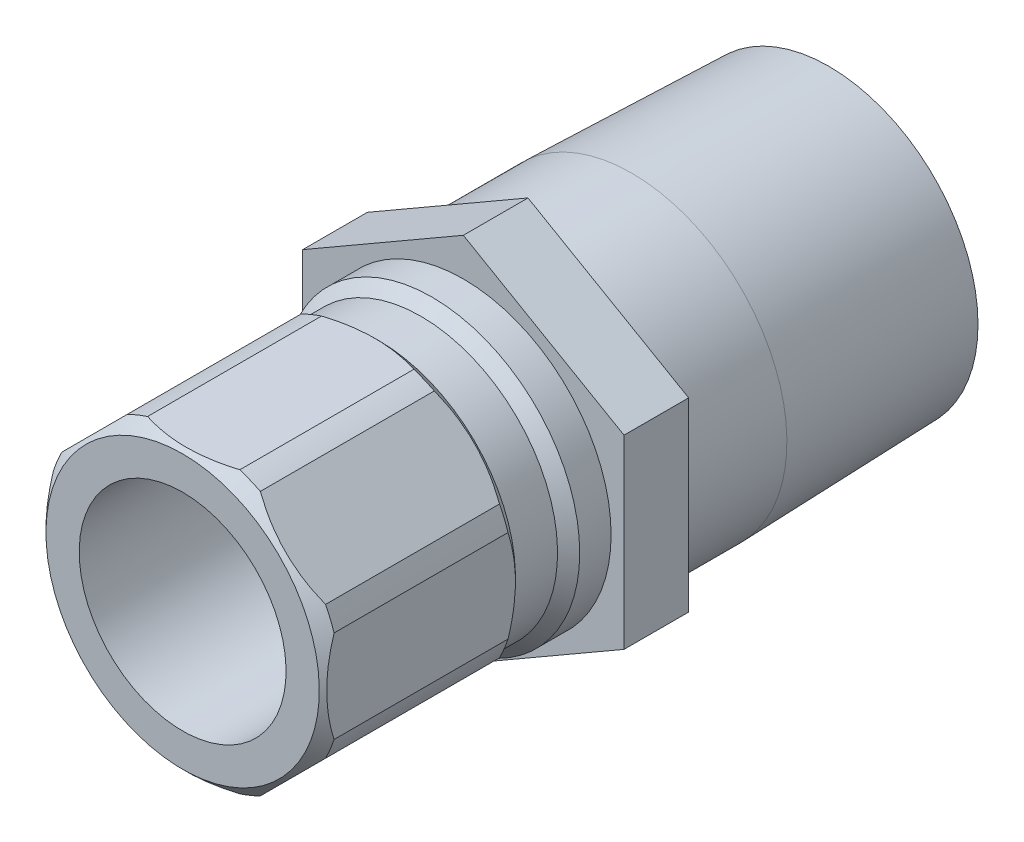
ISO-10303-21;
HEADER;
FILE_DESCRIPTION(('STEP AP214'),'2;1');
FILE_NAME('part.step','',(''),(''),'','','');
FILE_SCHEMA(('AUTOMOTIVE_DESIGN { 1 0 10303 214 1 1 1 1 }'));
ENDSEC;
DATA;
#1=APPLICATION_CONTEXT('core data for automotive mechanical design processes');
#2=APPLICATION_PROTOCOL_DEFINITION('international standard','automotive_design',2000,#1);
#3=PRODUCT_CONTEXT('',#1,'mechanical');
#4=PRODUCT('Part','Part','',(#3));
#5=PRODUCT_RELATED_PRODUCT_CATEGORY('part','',(#4));
#6=PRODUCT_DEFINITION_FORMATION('','',#4);
#7=PRODUCT_DEFINITION_CONTEXT('part definition',#1,'design');
#8=PRODUCT_DEFINITION('design','',#6,#7);
#9=PRODUCT_DEFINITION_SHAPE('','',#8);
#10=(LENGTH_UNIT() NAMED_UNIT(*) SI_UNIT(.MILLI.,.METRE.));
#11=(NAMED_UNIT(*) PLANE_ANGLE_UNIT() SI_UNIT($,.RADIAN.));
#12=(NAMED_UNIT(*) SI_UNIT($,.STERADIAN.) SOLID_ANGLE_UNIT());
#13=UNCERTAINTY_MEASURE_WITH_UNIT(LENGTH_MEASURE(1.E-05),#10,'distance_accuracy_value','');
#14=(GEOMETRIC_REPRESENTATION_CONTEXT(3) GLOBAL_UNCERTAINTY_ASSIGNED_CONTEXT((#13)) GLOBAL_UNIT_ASSIGNED_CONTEXT((#10,
#11,#12)) REPRESENTATION_CONTEXT('',''));
#15=CARTESIAN_POINT('',(0.,0.,0.));
#16=DIRECTION('',(0.,0.,1.));
#17=DIRECTION('',(1.,0.,0.));
#18=AXIS2_PLACEMENT_3D('',#15,#16,#17);
#19=CARTESIAN_POINT('',(0.,0.,0.));
#20=DIRECTION('',(0.,0.,-1.));
#21=DIRECTION('',(0.,1.,0.));
#22=AXIS2_PLACEMENT_3D('',#19,#20,#21);
#23=CYLINDRICAL_SURFACE('',#22,10.16);
#24=DIRECTION('',(0.,0.,-1.));
#25=VECTOR('',#24,1.);
#26=CARTESIAN_POINT('',(9.06826191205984,-4.58172739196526,0.));
#27=LINE('',#26,#25);
#28=CARTESIAN_POINT('',(9.06826191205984,-4.58172739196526,6.5786));
#29=VERTEX_POINT('',#28);
#30=CARTESIAN_POINT('',(9.06826191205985,-4.58172739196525,18.542));
#31=VERTEX_POINT('',#30);
#32=EDGE_CURVE('E400',#29,#31,#27,.F.);
#33=ORIENTED_EDGE('',*,*,#32,.F.);
#34=CARTESIAN_POINT('',(0.,0.,6.5786));
#35=DIRECTION('',(0.,0.,-1.));
#36=DIRECTION('',(0.,1.,0.));
#37=AXIS2_PLACEMENT_3D('',#34,#35,#36);
#38=CIRCLE('',#37,10.16);
#39=CARTESIAN_POINT('',(9.652,-3.17245898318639,6.5786));
#40=VERTEX_POINT('',#39);
#41=EDGE_CURVE('E402',#40,#29,#38,.T.);
#42=ORIENTED_EDGE('',*,*,#41,.F.);
#43=DIRECTION('',(0.,0.,-1.));
#44=VECTOR('',#43,1.);
#45=CARTESIAN_POINT('',(9.652,-3.17245898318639,0.));
#46=LINE('',#45,#44);
#47=CARTESIAN_POINT('',(9.652,-3.1724589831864,18.542));
#48=VERTEX_POINT('',#47);
#49=EDGE_CURVE('E380',#48,#40,#46,.T.);
#50=ORIENTED_EDGE('',*,*,#49,.F.);
#51=CARTESIAN_POINT('',(0.,0.,18.542));
#52=DIRECTION('',(0.,0.,-1.));
#53=DIRECTION('',(0.,1.,0.));
#54=AXIS2_PLACEMENT_3D('',#51,#52,#53);
#55=CIRCLE('',#54,10.16);
#56=EDGE_CURVE('E218',#48,#31,#55,.T.);
#57=ORIENTED_EDGE('',*,*,#56,.T.);
#58=EDGE_LOOP('',(#33,#42,#50,#57));
#59=FACE_BOUND('',#58,.T.);
#60=ADVANCED_FACE('F35',(#59),#23,.T.);
#61=DIRECTION('',(0.,0.,-1.));
#62=VECTOR('',#61,1.);
#63=CARTESIAN_POINT('',(9.652,3.1724589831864,0.));
#64=LINE('',#63,#62);
#65=CARTESIAN_POINT('',(9.652,3.1724589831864,6.5786));
#66=VERTEX_POINT('',#65);
#67=CARTESIAN_POINT('',(9.652,3.1724589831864,18.542));
#68=VERTEX_POINT('',#67);
#69=EDGE_CURVE('E321',#66,#68,#64,.F.);
#70=ORIENTED_EDGE('',*,*,#69,.F.);
#71=CARTESIAN_POINT('',(9.06826191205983,4.58172739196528,6.5786));
#72=VERTEX_POINT('',#71);
#73=EDGE_CURVE('E234',#72,#66,#38,.T.);
#74=ORIENTED_EDGE('',*,*,#73,.F.);
#75=DIRECTION('',(0.,0.,-1.));
#76=VECTOR('',#75,1.);
#77=CARTESIAN_POINT('',(9.06826191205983,4.58172739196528,0.));
#78=LINE('',#77,#76);
#79=CARTESIAN_POINT('',(9.06826191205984,4.58172739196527,18.542));
#80=VERTEX_POINT('',#79);
#81=EDGE_CURVE('E396',#80,#72,#78,.T.);
#82=ORIENTED_EDGE('',*,*,#81,.F.);
#83=EDGE_CURVE('E226',#80,#68,#55,.T.);
#84=ORIENTED_EDGE('',*,*,#83,.T.);
#85=EDGE_LOOP('',(#70,#74,#82,#84));
#86=FACE_BOUND('',#85,.T.);
#87=ADVANCED_FACE('F395',(#86),#23,.T.);
#88=DIRECTION('',(0.,0.,-1.));
#89=VECTOR('',#88,1.);
#90=CARTESIAN_POINT('',(4.58172739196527,9.06826191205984,0.));
#91=LINE('',#90,#89);
#92=CARTESIAN_POINT('',(4.58172739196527,9.06826191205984,6.5786));
#93=VERTEX_POINT('',#92);
#94=CARTESIAN_POINT('',(4.58172739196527,9.06826191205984,18.542));
#95=VERTEX_POINT('',#94);
#96=EDGE_CURVE('E381',#93,#95,#91,.F.);
#97=ORIENTED_EDGE('',*,*,#96,.F.);
#98=CARTESIAN_POINT('',(3.17245898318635,9.65200000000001,6.5786));
#99=VERTEX_POINT('',#98);
#100=EDGE_CURVE('E230',#99,#93,#38,.T.);
#101=ORIENTED_EDGE('',*,*,#100,.F.);
#102=DIRECTION('',(0.,0.,-1.));
#103=VECTOR('',#102,1.);
#104=CARTESIAN_POINT('',(3.17245898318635,9.65200000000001,0.));
#105=LINE('',#104,#103);
#106=CARTESIAN_POINT('',(3.17245898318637,9.65200000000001,18.542));
#107=VERTEX_POINT('',#106);
#108=EDGE_CURVE('E427',#107,#99,#105,.T.);
#109=ORIENTED_EDGE('',*,*,#108,.F.);
#110=EDGE_CURVE('E221',#107,#95,#55,.T.);
#111=ORIENTED_EDGE('',*,*,#110,.T.);
#112=EDGE_LOOP('',(#97,#101,#109,#111));
#113=FACE_BOUND('',#112,.T.);
#114=ADVANCED_FACE('F530',(#113),#23,.T.);
#115=DIRECTION('',(0.,0.,-1.));
#116=VECTOR('',#115,1.);
#117=CARTESIAN_POINT('',(-3.17245898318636,9.65200000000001,0.));
#118=LINE('',#117,#116);
#119=CARTESIAN_POINT('',(-3.17245898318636,9.65200000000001,6.5786));
#120=VERTEX_POINT('',#119);
#121=CARTESIAN_POINT('',(-3.17245898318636,9.65200000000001,18.542));
#122=VERTEX_POINT('',#121);
#123=EDGE_CURVE('E55',#120,#122,#118,.F.);
#124=ORIENTED_EDGE('',*,*,#123,.F.);
#125=CARTESIAN_POINT('',(-4.5817273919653,9.06826191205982,6.5786));
#126=VERTEX_POINT('',#125);
#127=EDGE_CURVE('E225',#126,#120,#38,.T.);
#128=ORIENTED_EDGE('',*,*,#127,.F.);
#129=DIRECTION('',(0.,0.,-1.));
#130=VECTOR('',#129,1.);
#131=CARTESIAN_POINT('',(-4.5817273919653,9.06826191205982,0.));
#132=LINE('',#131,#130);
#133=CARTESIAN_POINT('',(-4.58172739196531,9.06826191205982,18.542));
#134=VERTEX_POINT('',#133);
#135=EDGE_CURVE('E425',#134,#126,#132,.T.);
#136=ORIENTED_EDGE('',*,*,#135,.F.);
#137=EDGE_CURVE('E227',#134,#122,#55,.T.);
#138=ORIENTED_EDGE('',*,*,#137,.T.);
#139=EDGE_LOOP('',(#124,#128,#136,#138));
#140=FACE_BOUND('',#139,.T.);
#141=ADVANCED_FACE('F423',(#140),#23,.T.);
#142=DIRECTION('',(0.,0.,-1.));
#143=VECTOR('',#142,1.);
#144=CARTESIAN_POINT('',(-9.06826191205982,4.58172739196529,0.));
#145=LINE('',#144,#143);
#146=CARTESIAN_POINT('',(-9.06826191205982,4.58172739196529,6.5786));
#147=VERTEX_POINT('',#146);
#148=CARTESIAN_POINT('',(-9.06826191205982,4.5817273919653,18.542));
#149=VERTEX_POINT('',#148);
#150=EDGE_CURVE('E63',#147,#149,#145,.F.);
#151=ORIENTED_EDGE('',*,*,#150,.F.);
#152=CARTESIAN_POINT('',(-9.652,3.17245898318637,6.5786));
#153=VERTEX_POINT('',#152);
#154=EDGE_CURVE('E410',#153,#147,#38,.T.);
#155=ORIENTED_EDGE('',*,*,#154,.F.);
#156=DIRECTION('',(0.,0.,-1.));
#157=VECTOR('',#156,1.);
#158=CARTESIAN_POINT('',(-9.652,3.17245898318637,0.));
#159=LINE('',#158,#157);
#160=CARTESIAN_POINT('',(-9.652,3.17245898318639,18.542));
#161=VERTEX_POINT('',#160);
#162=EDGE_CURVE('E432',#161,#153,#159,.T.);
#163=ORIENTED_EDGE('',*,*,#162,.F.);
#164=EDGE_CURVE('E220',#161,#149,#55,.T.);
#165=ORIENTED_EDGE('',*,*,#164,.T.);
#166=EDGE_LOOP('',(#151,#155,#163,#165));
#167=FACE_BOUND('',#166,.T.);
#168=ADVANCED_FACE('F515',(#167),#23,.T.);
#169=DIRECTION('',(0.,0.,-1.));
#170=VECTOR('',#169,1.);
#171=CARTESIAN_POINT('',(-9.652,-3.17245898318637,0.));
#172=LINE('',#171,#170);
#173=CARTESIAN_POINT('',(-9.652,-3.17245898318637,6.5786));
#174=VERTEX_POINT('',#173);
#175=CARTESIAN_POINT('',(-9.652,-3.17245898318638,18.542));
#176=VERTEX_POINT('',#175);
#177=EDGE_CURVE('E429',#174,#176,#172,.F.);
#178=ORIENTED_EDGE('',*,*,#177,.F.);
#179=CARTESIAN_POINT('',(-9.06826191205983,-4.58172739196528,6.5786));
#180=VERTEX_POINT('',#179);
#181=EDGE_CURVE('E407',#180,#174,#38,.T.);
#182=ORIENTED_EDGE('',*,*,#181,.F.);
#183=DIRECTION('',(0.,0.,-1.));
#184=VECTOR('',#183,1.);
#185=CARTESIAN_POINT('',(-9.06826191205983,-4.58172739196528,0.));
#186=LINE('',#185,#184);
#187=CARTESIAN_POINT('',(-9.06826191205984,-4.58172739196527,18.542));
#188=VERTEX_POINT('',#187);
#189=EDGE_CURVE('E437',#188,#180,#186,.T.);
#190=ORIENTED_EDGE('',*,*,#189,.F.);
#191=EDGE_CURVE('E216',#188,#176,#55,.T.);
#192=ORIENTED_EDGE('',*,*,#191,.T.);
#193=EDGE_LOOP('',(#178,#182,#190,#192));
#194=FACE_BOUND('',#193,.T.);
#195=ADVANCED_FACE('F518',(#194),#23,.T.);
#196=DIRECTION('',(0.,0.,-1.));
#197=VECTOR('',#196,1.);
#198=CARTESIAN_POINT('',(-4.58172739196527,-9.06826191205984,0.));
#199=LINE('',#198,#197);
#200=CARTESIAN_POINT('',(-4.58172739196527,-9.06826191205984,6.5786));
#201=VERTEX_POINT('',#200);
#202=CARTESIAN_POINT('',(-4.58172739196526,-9.06826191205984,18.542));
#203=VERTEX_POINT('',#202);
#204=EDGE_CURVE('E435',#201,#203,#199,.F.);
#205=ORIENTED_EDGE('',*,*,#204,.F.);
#206=CARTESIAN_POINT('',(-3.1724589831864,-9.65199999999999,6.5786));
#207=VERTEX_POINT('',#206);
#208=EDGE_CURVE('E208',#207,#201,#38,.T.);
#209=ORIENTED_EDGE('',*,*,#208,.F.);
#210=DIRECTION('',(0.,0.,-1.));
#211=VECTOR('',#210,1.);
#212=CARTESIAN_POINT('',(-3.1724589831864,-9.65199999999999,0.));
#213=LINE('',#212,#211);
#214=CARTESIAN_POINT('',(-3.17245898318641,-9.652,18.542));
#215=VERTEX_POINT('',#214);
#216=EDGE_CURVE('E190',#215,#207,#213,.T.);
#217=ORIENTED_EDGE('',*,*,#216,.F.);
#218=EDGE_CURVE('E206',#215,#203,#55,.T.);
#219=ORIENTED_EDGE('',*,*,#218,.T.);
#220=EDGE_LOOP('',(#205,#209,#217,#219));
#221=FACE_BOUND('',#220,.T.);
#222=ADVANCED_FACE('F205',(#221),#23,.T.);
#223=CARTESIAN_POINT('',(0.,0.,0.));
#224=DIRECTION('',(0.,0.,-1.));
#225=DIRECTION('',(0.,1.,0.));
#226=AXIS2_PLACEMENT_3D('',#223,#224,#225);
#227=CYLINDRICAL_SURFACE('',#226,10.668);
#228=CARTESIAN_POINT('',(0.,0.,-11.5824));
#229=DIRECTION('',(0.,0.,-1.));
#230=DIRECTION('',(0.,1.,0.));
#231=AXIS2_PLACEMENT_3D('',#228,#229,#230);
#232=CIRCLE('',#231,10.668);
#233=CARTESIAN_POINT('',(0.,10.668,-11.5824));
#234=VERTEX_POINT('',#233);
#235=EDGE_CURVE('E246',#234,#234,#232,.T.);
#236=ORIENTED_EDGE('',*,*,#235,.F.);
#237=EDGE_LOOP('',(#236));
#238=FACE_BOUND('',#237,.T.);
#239=CARTESIAN_POINT('',(0.,0.,-4.445));
#240=DIRECTION('',(0.,0.,1.));
#241=DIRECTION('',(1.,0.,0.));
#242=AXIS2_PLACEMENT_3D('',#239,#240,#241);
#243=CIRCLE('',#242,10.668);
#244=CARTESIAN_POINT('',(10.668,0.,-4.445));
#245=VERTEX_POINT('',#244);
#246=EDGE_CURVE('E486',#245,#245,#243,.F.);
#247=ORIENTED_EDGE('',*,*,#246,.T.);
#248=EDGE_LOOP('',(#247));
#249=FACE_BOUND('',#248,.T.);
#250=ADVANCED_FACE('F524',(#238,#249),#227,.T.);
#251=CARTESIAN_POINT('',(0.,10.244140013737,-25.146));
#252=DIRECTION('',(0.,0.,-1.));
#253=DIRECTION('',(0.,1.,0.));
#254=AXIS2_PLACEMENT_3D('',#251,#252,#253);
#255=PLANE('',#254);
#256=CARTESIAN_POINT('',(0.,0.,-25.146));
#257=DIRECTION('',(0.,0.,-1.));
#258=DIRECTION('',(0.,1.,0.));
#259=AXIS2_PLACEMENT_3D('',#256,#257,#258);
#260=CIRCLE('',#259,10.244140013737);
#261=CARTESIAN_POINT('',(0.,10.244140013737,-25.146));
#262=VERTEX_POINT('',#261);
#263=EDGE_CURVE('E199',#262,#262,#260,.T.);
#264=ORIENTED_EDGE('',*,*,#263,.T.);
#265=EDGE_LOOP('',(#264));
#266=FACE_BOUND('',#265,.T.);
#267=CARTESIAN_POINT('',(0.,0.,-25.146));
#268=DIRECTION('',(0.,0.,-1.));
#269=DIRECTION('',(0.,1.,0.));
#270=AXIS2_PLACEMENT_3D('',#267,#268,#269);
#271=CIRCLE('',#270,7.8994);
#272=CARTESIAN_POINT('',(0.,7.8994,-25.146));
#273=VERTEX_POINT('',#272);
#274=EDGE_CURVE('E498',#273,#273,#271,.T.);
#275=ORIENTED_EDGE('',*,*,#274,.F.);
#276=EDGE_LOOP('',(#275));
#277=FACE_BOUND('',#276,.T.);
#278=ADVANCED_FACE('F37',(#266,#277),#255,.T.);
#279=CARTESIAN_POINT('',(0.,0.,-25.146));
#280=DIRECTION('',(0.,0.,1.));
#281=DIRECTION('',(0.,-1.,0.));
#282=AXIS2_PLACEMENT_3D('',#279,#280,#281);
#283=CONICAL_SURFACE('',#282,10.244140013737,0.0312396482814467);
#284=ORIENTED_EDGE('',*,*,#235,.T.);
#285=EDGE_LOOP('',(#284));
#286=FACE_BOUND('',#285,.T.);
#287=ORIENTED_EDGE('',*,*,#263,.F.);
#288=EDGE_LOOP('',(#287));
#289=FACE_BOUND('',#288,.T.);
#290=ADVANCED_FACE('F704',(#286,#289),#283,.T.);
#291=CARTESIAN_POINT('',(0.,10.16,0.));
#292=DIRECTION('',(0.,0.,1.));
#293=DIRECTION('',(0.,-1.,0.));
#294=AXIS2_PLACEMENT_3D('',#291,#292,#293);
#295=PLANE('',#294);
#296=CARTESIAN_POINT('',(0.,0.,0.));
#297=DIRECTION('',(0.,0.,-1.));
#298=DIRECTION('',(0.,1.,0.));
#299=AXIS2_PLACEMENT_3D('',#296,#297,#298);
#300=CIRCLE('',#299,10.16);
#301=CARTESIAN_POINT('',(0.,10.16,0.));
#302=VERTEX_POINT('',#301);
#303=EDGE_CURVE('E243',#302,#302,#300,.T.);
#304=ORIENTED_EDGE('',*,*,#303,.T.);
#305=EDGE_LOOP('',(#304));
#306=FACE_BOUND('',#305,.T.);
#307=DIRECTION('',(-0.866025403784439,-0.5,0.));
#308=VECTOR('',#307,1.);
#309=CARTESIAN_POINT('',(0.,12.7582862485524,0.));
#310=LINE('',#309,#308);
#311=CARTESIAN_POINT('',(0.,12.7582862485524,0.));
#312=VERTEX_POINT('',#311);
#313=CARTESIAN_POINT('',(-11.049,6.37914312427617,0.));
#314=VERTEX_POINT('',#313);
#315=EDGE_CURVE('E443',#312,#314,#310,.T.);
#316=ORIENTED_EDGE('',*,*,#315,.T.);
#317=DIRECTION('',(0.,-1.,0.));
#318=VECTOR('',#317,1.);
#319=CARTESIAN_POINT('',(-11.049,6.37914312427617,0.));
#320=LINE('',#319,#318);
#321=CARTESIAN_POINT('',(-11.049,-6.37914312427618,0.));
#322=VERTEX_POINT('',#321);
#323=EDGE_CURVE('E470',#314,#322,#320,.T.);
#324=ORIENTED_EDGE('',*,*,#323,.T.);
#325=DIRECTION('',(0.866025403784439,-0.5,0.));
#326=VECTOR('',#325,1.);
#327=CARTESIAN_POINT('',(-11.049,-6.37914312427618,0.));
#328=LINE('',#327,#326);
#329=CARTESIAN_POINT('',(0.,-12.7582862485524,0.));
#330=VERTEX_POINT('',#329);
#331=EDGE_CURVE('E473',#322,#330,#328,.T.);
#332=ORIENTED_EDGE('',*,*,#331,.T.);
#333=DIRECTION('',(0.866025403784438,0.5,0.));
#334=VECTOR('',#333,1.);
#335=CARTESIAN_POINT('',(0.,-12.7582862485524,0.));
#336=LINE('',#335,#334);
#337=CARTESIAN_POINT('',(11.049,-6.37914312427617,0.));
#338=VERTEX_POINT('',#337);
#339=EDGE_CURVE('E476',#330,#338,#336,.T.);
#340=ORIENTED_EDGE('',*,*,#339,.T.);
#341=DIRECTION('',(0.,1.,0.));
#342=VECTOR('',#341,1.);
#343=CARTESIAN_POINT('',(11.049,-6.37914312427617,0.));
#344=LINE('',#343,#342);
#345=CARTESIAN_POINT('',(11.049,6.37914312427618,0.));
#346=VERTEX_POINT('',#345);
#347=EDGE_CURVE('E479',#338,#346,#344,.T.);
#348=ORIENTED_EDGE('',*,*,#347,.T.);
#349=DIRECTION('',(-0.866025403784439,0.5,0.));
#350=VECTOR('',#349,1.);
#351=CARTESIAN_POINT('',(11.049,6.37914312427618,0.));
#352=LINE('',#351,#350);
#353=EDGE_CURVE('E452',#346,#312,#352,.T.);
#354=ORIENTED_EDGE('',*,*,#353,.T.);
#355=EDGE_LOOP('',(#316,#324,#332,#340,#348,#354));
#356=FACE_BOUND('',#355,.T.);
#357=ADVANCED_FACE('F696',(#306,#356),#295,.T.);
#358=CARTESIAN_POINT('',(0.,0.,0.));
#359=DIRECTION('',(0.,0.,-1.));
#360=DIRECTION('',(0.,1.,0.));
#361=AXIS2_PLACEMENT_3D('',#358,#359,#360);
#362=CYLINDRICAL_SURFACE('',#361,10.16);
#363=CARTESIAN_POINT('',(0.,0.,2.159));
#364=DIRECTION('',(0.,0.,-1.));
#365=DIRECTION('',(0.,1.,0.));
#366=AXIS2_PLACEMENT_3D('',#363,#364,#365);
#367=CIRCLE('',#366,10.16);
#368=CARTESIAN_POINT('',(0.,10.16,2.159));
#369=VERTEX_POINT('',#368);
#370=EDGE_CURVE('E240',#369,#369,#367,.T.);
#371=ORIENTED_EDGE('',*,*,#370,.T.);
#372=EDGE_LOOP('',(#371));
#373=FACE_BOUND('',#372,.T.);
#374=ORIENTED_EDGE('',*,*,#303,.F.);
#375=EDGE_LOOP('',(#374));
#376=FACE_BOUND('',#375,.T.);
#377=ADVANCED_FACE('F703',(#373,#376),#362,.T.);
#378=CARTESIAN_POINT('',(0.,0.,2.159));
#379=DIRECTION('',(0.,0.,-1.));
#380=DIRECTION('',(0.,1.,0.));
#381=AXIS2_PLACEMENT_3D('',#378,#379,#380);
#382=CONICAL_SURFACE('',#381,10.16,0.785398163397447);
#383=CARTESIAN_POINT('',(0.,0.,2.921));
#384=DIRECTION('',(0.,0.,-1.));
#385=DIRECTION('',(0.,1.,0.));
#386=AXIS2_PLACEMENT_3D('',#383,#384,#385);
#387=CIRCLE('',#386,9.398);
#388=CARTESIAN_POINT('',(0.,9.398,2.921));
#389=VERTEX_POINT('',#388);
#390=EDGE_CURVE('E237',#389,#389,#387,.T.);
#391=ORIENTED_EDGE('',*,*,#390,.T.);
#392=EDGE_LOOP('',(#391));
#393=FACE_BOUND('',#392,.T.);
#394=ORIENTED_EDGE('',*,*,#370,.F.);
#395=EDGE_LOOP('',(#394));
#396=FACE_BOUND('',#395,.T.);
#397=ADVANCED_FACE('F762',(#393,#396),#382,.T.);
#398=CARTESIAN_POINT('',(0.,0.,0.));
#399=DIRECTION('',(0.,0.,-1.));
#400=DIRECTION('',(0.,1.,0.));
#401=AXIS2_PLACEMENT_3D('',#398,#399,#400);
#402=CYLINDRICAL_SURFACE('',#401,9.398);
#403=CARTESIAN_POINT('',(0.,0.,5.8166));
#404=DIRECTION('',(0.,0.,-1.));
#405=DIRECTION('',(0.,1.,0.));
#406=AXIS2_PLACEMENT_3D('',#403,#404,#405);
#407=CIRCLE('',#406,9.398);
#408=CARTESIAN_POINT('',(0.,9.398,5.8166));
#409=VERTEX_POINT('',#408);
#410=EDGE_CURVE('E233',#409,#409,#407,.T.);
#411=ORIENTED_EDGE('',*,*,#410,.T.);
#412=EDGE_LOOP('',(#411));
#413=FACE_BOUND('',#412,.T.);
#414=ORIENTED_EDGE('',*,*,#390,.F.);
#415=EDGE_LOOP('',(#414));
#416=FACE_BOUND('',#415,.T.);
#417=ADVANCED_FACE('F328',(#413,#416),#402,.T.);
#418=CARTESIAN_POINT('',(0.,0.,5.8166));
#419=DIRECTION('',(0.,0.,1.));
#420=DIRECTION('',(0.,-1.,0.));
#421=AXIS2_PLACEMENT_3D('',#418,#419,#420);
#422=CONICAL_SURFACE('',#421,9.398,0.785398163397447);
#423=CARTESIAN_POINT('',(4.58127452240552,-9.06871478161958,6.57880000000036));
#424=CARTESIAN_POINT('',(4.75252279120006,-8.89746651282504,6.50311112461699));
#425=CARTESIAN_POINT('',(4.92544531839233,-8.72454398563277,6.4345998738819));
#426=CARTESIAN_POINT('',(5.27427443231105,-8.37571487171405,6.31373109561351));
#427=CARTESIAN_POINT('',(5.45018402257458,-8.19980528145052,6.26139098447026));
#428=CARTESIAN_POINT('',(5.80016102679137,-7.84982827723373,6.17583376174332));
#429=CARTESIAN_POINT('',(5.97417704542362,-7.67581225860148,6.14220261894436));
#430=CARTESIAN_POINT('',(6.32342358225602,-7.32656572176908,6.09351088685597));
#431=CARTESIAN_POINT('',(6.4986534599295,-7.15133584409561,6.07844115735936));
#432=CARTESIAN_POINT('',(6.87393872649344,-6.77605057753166,6.06671407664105));
#433=CARTESIAN_POINT('',(7.07404283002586,-6.57594647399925,6.07292266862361));
#434=CARTESIAN_POINT('',(7.47322940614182,-6.17675989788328,6.10993961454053));
#435=CARTESIAN_POINT('',(7.67231100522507,-5.97767829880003,6.14076631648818));
#436=CARTESIAN_POINT('',(8.07332223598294,-5.57666706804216,6.22661050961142));
#437=CARTESIAN_POINT('',(8.27518426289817,-5.37480504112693,6.28225688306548));
#438=CARTESIAN_POINT('',(8.57507776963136,-5.07491153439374,6.38192162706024));
#439=CARTESIAN_POINT('',(8.67450584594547,-4.97548345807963,6.41781854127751));
#440=CARTESIAN_POINT('',(8.87236427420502,-4.77762502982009,6.49463428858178));
#441=CARTESIAN_POINT('',(8.97079484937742,-4.67919445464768,6.53555196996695));
#442=CARTESIAN_POINT('',(9.06871478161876,-4.58127452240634,6.5788));
#443=B_SPLINE_CURVE_WITH_KNOTS('',3,(#423,#424,#425,#426,#427,#428,#429,#430,#431,#432,#433,
#434,#435,#436,#437,#438,#439,#440,#441,#442),.UNSPECIFIED.,.F.,.F.,(4,2,2,2,2,2,2,2,2,4),(0.,
0.761268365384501,1.52335378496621,2.26782503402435,3.01192953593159,3.85997332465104,
4.7086497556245,5.58017277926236,6.01546212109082,6.45065179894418),.UNSPECIFIED.);
#444=CARTESIAN_POINT('',(4.58172739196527,-9.06826191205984,6.5786));
#445=VERTEX_POINT('',#444);
#446=EDGE_CURVE('E442',#445,#29,#443,.T.);
#447=ORIENTED_EDGE('',*,*,#446,.F.);
#448=CARTESIAN_POINT('',(3.1724589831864,-9.65199999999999,6.5786));
#449=VERTEX_POINT('',#448);
#450=EDGE_CURVE('E404',#445,#449,#38,.T.);
#451=ORIENTED_EDGE('',*,*,#450,.T.);
#452=CARTESIAN_POINT('',(-7.71050187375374,-9.652,8.77226112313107));
#453=CARTESIAN_POINT('',(-7.5247548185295,-9.652,8.65634461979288));
#454=CARTESIAN_POINT('',(-7.33786285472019,-9.652,8.54223754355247));
#455=CARTESIAN_POINT('',(-6.96152272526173,-9.652,8.31821876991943));
#456=CARTESIAN_POINT('',(-6.77207395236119,-9.652,8.20830809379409));
#457=CARTESIAN_POINT('',(-6.38961701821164,-9.652,7.99284972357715));
#458=CARTESIAN_POINT('',(-6.19659699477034,-9.652,7.88732298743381));
#459=CARTESIAN_POINT('',(-5.80760245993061,-9.652,7.6819077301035));
#460=CARTESIAN_POINT('',(-5.61162813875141,-9.652,7.58201884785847));
#461=CARTESIAN_POINT('',(-5.0102125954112,-9.652,7.28777670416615));
#462=CARTESIAN_POINT('',(-4.59965798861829,-9.652,7.10365831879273));
#463=CARTESIAN_POINT('',(-3.76461195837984,-9.652,6.77173137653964));
#464=CARTESIAN_POINT('',(-3.34014745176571,-9.652,6.62385690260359));
#465=CARTESIAN_POINT('',(-2.66836152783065,-9.652,6.43000243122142));
#466=CARTESIAN_POINT('',(-2.42567962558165,-9.652,6.36787612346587));
#467=CARTESIAN_POINT('',(-1.9366245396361,-9.652,6.260082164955));
#468=CARTESIAN_POINT('',(-1.69025117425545,-9.652,6.21441532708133));
#469=CARTESIAN_POINT('',(-1.1971622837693,-9.652,6.14153377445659));
#470=CARTESIAN_POINT('',(-0.950472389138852,-9.652,6.11414737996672));
#471=CARTESIAN_POINT('',(-0.455710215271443,-9.652,6.07820091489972));
#472=CARTESIAN_POINT('',(-0.207637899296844,-9.65199999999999,6.0696413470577));
#473=CARTESIAN_POINT('',(0.333683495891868,-9.65199999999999,6.07191804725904));
#474=CARTESIAN_POINT('',(0.626923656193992,-9.65199999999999,6.0865748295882));
#475=CARTESIAN_POINT('',(1.21094277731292,-9.65199999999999,6.14191623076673));
#476=CARTESIAN_POINT('',(1.501721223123,-9.65199999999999,6.1826061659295));
#477=CARTESIAN_POINT('',(2.08266136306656,-9.65199999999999,6.28854909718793));
#478=CARTESIAN_POINT('',(2.3727646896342,-9.65199999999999,6.3541179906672));
#479=CARTESIAN_POINT('',(2.94714147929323,-9.65199999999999,6.50671348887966));
#480=CARTESIAN_POINT('',(3.23141585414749,-9.65199999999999,6.5937367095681));
#481=CARTESIAN_POINT('',(3.82869981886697,-9.65199999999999,6.79798966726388));
#482=CARTESIAN_POINT('',(4.14087760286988,-9.65199999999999,6.91763184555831));
#483=CARTESIAN_POINT('',(4.75742701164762,-9.65199999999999,7.17572587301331));
#484=CARTESIAN_POINT('',(5.06179505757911,-9.65199999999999,7.31418616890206));
#485=CARTESIAN_POINT('',(5.66409479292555,-9.65199999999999,7.60669849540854));
#486=CARTESIAN_POINT('',(5.9620026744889,-9.65199999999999,7.76079916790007));
#487=CARTESIAN_POINT('',(6.55107386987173,-9.65199999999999,8.0812155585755));
#488=CARTESIAN_POINT('',(6.84223818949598,-9.65199999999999,8.24752943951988));
#489=CARTESIAN_POINT('',(7.40668231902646,-9.65199999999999,8.58292080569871));
#490=CARTESIAN_POINT('',(7.68020242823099,-9.65199999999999,8.75159598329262));
#491=CARTESIAN_POINT('',(8.22250898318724,-9.65199999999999,9.09641460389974));
#492=CARTESIAN_POINT('',(8.49129505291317,-9.65199999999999,9.27255863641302));
#493=CARTESIAN_POINT('',(9.02258177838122,-9.65199999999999,9.62956600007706));
#494=CARTESIAN_POINT('',(9.28511552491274,-9.65199999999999,9.8103802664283));
#495=CARTESIAN_POINT('',(9.80652727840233,-9.65199999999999,10.1770543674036));
#496=CARTESIAN_POINT('',(10.0654063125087,-9.65199999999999,10.3629127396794));
#497=CARTESIAN_POINT('',(10.3227473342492,-9.65199999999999,10.5508403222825));
#498=B_SPLINE_CURVE_WITH_KNOTS('',3,(#452,#453,#454,#455,#456,#457,#458,#459,#460,#461,#462,
#463,#464,#465,#466,#467,#468,#469,#470,#471,#472,#473,#474,#475,#476,#477,#478,#479,#480,#481,
#482,#483,#484,#485,#486,#487,#488,#489,#490,#491,#492,#493,#494,#495,#496,#497),.UNSPECIFIED.,
.F.,.F.,(4,2,2,2,2,2,2,2,2,2,2,2,2,2,2,2,2,2,2,2,2,2,4),(0.,0.656855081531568,1.31386901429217,
1.97372850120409,2.63354568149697,3.98211483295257,5.32821282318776,6.07925616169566,
6.83033658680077,7.57426013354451,8.31820354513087,9.1977741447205,10.0775244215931,
10.9688407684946,11.8600166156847,12.8622077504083,13.8648502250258,14.8707124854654,
15.8764237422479,16.8403261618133,17.8043048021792,18.7605668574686,19.7165545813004),.UNSPECIFIED.);
#499=EDGE_CURVE('E334',#207,#449,#498,.T.);
#500=ORIENTED_EDGE('',*,*,#499,.F.);
#501=ORIENTED_EDGE('',*,*,#208,.T.);
#502=CARTESIAN_POINT('',(-9.06871478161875,-4.58127452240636,6.5788));
#503=CARTESIAN_POINT('',(-8.89746651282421,-4.7525227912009,6.50311112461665));
#504=CARTESIAN_POINT('',(-8.72454398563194,-4.92544531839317,6.43459987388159));
#505=CARTESIAN_POINT('',(-8.37571487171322,-5.27427443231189,6.31373109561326));
#506=CARTESIAN_POINT('',(-8.1998052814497,-5.45018402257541,6.26139098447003));
#507=CARTESIAN_POINT('',(-7.84982827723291,-5.8001610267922,6.17583376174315));
#508=CARTESIAN_POINT('',(-7.67581225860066,-5.97417704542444,6.14220261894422));
#509=CARTESIAN_POINT('',(-7.32656572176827,-6.32342358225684,6.09351088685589));
#510=CARTESIAN_POINT('',(-7.1513358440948,-6.49865345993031,6.07844115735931));
#511=CARTESIAN_POINT('',(-6.77605057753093,-6.87393872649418,6.06671407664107));
#512=CARTESIAN_POINT('',(-6.57594647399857,-7.07404283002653,6.07292266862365));
#513=CARTESIAN_POINT('',(-6.17675989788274,-7.47322940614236,6.10993961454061));
#514=CARTESIAN_POINT('',(-5.97767829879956,-7.67231100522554,6.14076631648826));
#515=CARTESIAN_POINT('',(-5.57666706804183,-8.07332223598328,6.22661050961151));
#516=CARTESIAN_POINT('',(-5.37480504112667,-8.27518426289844,6.28225688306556));
#517=CARTESIAN_POINT('',(-5.07491153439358,-8.57507776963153,6.3819216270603));
#518=CARTESIAN_POINT('',(-4.97548345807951,-8.6745058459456,6.41781854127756));
#519=CARTESIAN_POINT('',(-4.77762502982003,-8.87236427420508,6.49463428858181));
#520=CARTESIAN_POINT('',(-4.67919445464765,-8.97079484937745,6.53555196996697));
#521=CARTESIAN_POINT('',(-4.58127452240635,-9.06871478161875,6.5788));
#522=B_SPLINE_CURVE_WITH_KNOTS('',3,(#502,#503,#504,#505,#506,#507,#508,#509,#510,#511,#512,
#513,#514,#515,#516,#517,#518,#519,#520,#521),.UNSPECIFIED.,.F.,.F.,(4,2,2,2,2,2,2,2,2,4),(0.,
0.761268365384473,1.52335378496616,2.26782503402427,3.01192953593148,3.85997332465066,
4.70864975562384,5.58017277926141,6.01546212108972,6.45065179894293),.UNSPECIFIED.);
#523=EDGE_CURVE('E344',#180,#201,#522,.T.);
#524=ORIENTED_EDGE('',*,*,#523,.F.);
#525=ORIENTED_EDGE('',*,*,#181,.T.);
#526=CARTESIAN_POINT('',(-9.652,-7.71050187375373,8.77226112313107));
#527=CARTESIAN_POINT('',(-9.652,-7.52475481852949,8.65634461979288));
#528=CARTESIAN_POINT('',(-9.652,-7.33786285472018,8.54223754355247));
#529=CARTESIAN_POINT('',(-9.652,-6.96152272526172,8.31821876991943));
#530=CARTESIAN_POINT('',(-9.652,-6.77207395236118,8.20830809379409));
#531=CARTESIAN_POINT('',(-9.652,-6.38961701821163,7.99284972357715));
#532=CARTESIAN_POINT('',(-9.652,-6.19659699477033,7.88732298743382));
#533=CARTESIAN_POINT('',(-9.652,-5.80760245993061,7.6819077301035));
#534=CARTESIAN_POINT('',(-9.652,-5.6116281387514,7.58201884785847));
#535=CARTESIAN_POINT('',(-9.652,-5.01021259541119,7.28777670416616));
#536=CARTESIAN_POINT('',(-9.652,-4.59965798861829,7.10365831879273));
#537=CARTESIAN_POINT('',(-9.652,-3.76461195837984,6.77173137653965));
#538=CARTESIAN_POINT('',(-9.652,-3.34014745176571,6.6238569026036));
#539=CARTESIAN_POINT('',(-9.652,-2.66836152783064,6.43000243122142));
#540=CARTESIAN_POINT('',(-9.652,-2.42567962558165,6.36787612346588));
#541=CARTESIAN_POINT('',(-9.652,-1.9366245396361,6.260082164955));
#542=CARTESIAN_POINT('',(-9.652,-1.69025117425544,6.21441532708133));
#543=CARTESIAN_POINT('',(-9.652,-1.1971622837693,6.1415337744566));
#544=CARTESIAN_POINT('',(-9.652,-0.950472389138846,6.11414737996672));
#545=CARTESIAN_POINT('',(-9.652,-0.455710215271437,6.07820091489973));
#546=CARTESIAN_POINT('',(-9.652,-0.207637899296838,6.06964134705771));
#547=CARTESIAN_POINT('',(-9.652,0.333683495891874,6.07191804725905));
#548=CARTESIAN_POINT('',(-9.652,0.626923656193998,6.08657482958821));
#549=CARTESIAN_POINT('',(-9.652,1.21094277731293,6.14191623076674));
#550=CARTESIAN_POINT('',(-9.652,1.501721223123,6.18260616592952));
#551=CARTESIAN_POINT('',(-9.652,2.08266136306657,6.28854909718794));
#552=CARTESIAN_POINT('',(-9.652,2.37276468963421,6.35411799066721));
#553=CARTESIAN_POINT('',(-9.652,2.94714147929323,6.50671348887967));
#554=CARTESIAN_POINT('',(-9.652,3.2314158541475,6.59373670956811));
#555=CARTESIAN_POINT('',(-9.652,3.82869981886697,6.79798966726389));
#556=CARTESIAN_POINT('',(-9.652,4.14087760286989,6.91763184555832));
#557=CARTESIAN_POINT('',(-9.652,4.75742701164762,7.17572587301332));
#558=CARTESIAN_POINT('',(-9.652,5.06179505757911,7.31418616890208));
#559=CARTESIAN_POINT('',(-9.652,5.66409479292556,7.60669849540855));
#560=CARTESIAN_POINT('',(-9.652,5.96200267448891,7.76079916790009));
#561=CARTESIAN_POINT('',(-9.652,6.55107386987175,8.08121555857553));
#562=CARTESIAN_POINT('',(-9.652,6.84223818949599,8.2475294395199));
#563=CARTESIAN_POINT('',(-9.652,7.40668231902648,8.58292080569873));
#564=CARTESIAN_POINT('',(-9.652,7.68020242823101,8.75159598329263));
#565=CARTESIAN_POINT('',(-9.652,8.22250898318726,9.09641460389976));
#566=CARTESIAN_POINT('',(-9.652,8.49129505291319,9.27255863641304));
#567=CARTESIAN_POINT('',(-9.652,9.02258177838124,9.62956600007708));
#568=CARTESIAN_POINT('',(-9.652,9.28511552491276,9.81038026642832));
#569=CARTESIAN_POINT('',(-9.652,9.80652727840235,10.1770543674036));
#570=CARTESIAN_POINT('',(-9.652,10.0654063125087,10.3629127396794));
#571=CARTESIAN_POINT('',(-9.652,10.3227473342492,10.5508403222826));
#572=B_SPLINE_CURVE_WITH_KNOTS('',3,(#526,#527,#528,#529,#530,#531,#532,#533,#534,#535,#536,
#537,#538,#539,#540,#541,#542,#543,#544,#545,#546,#547,#548,#549,#550,#551,#552,#553,#554,#555,
#556,#557,#558,#559,#560,#561,#562,#563,#564,#565,#566,#567,#568,#569,#570,#571),.UNSPECIFIED.,
.F.,.F.,(4,2,2,2,2,2,2,2,2,2,2,2,2,2,2,2,2,2,2,2,2,2,4),(0.,0.656855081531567,1.31386901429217,
1.97372850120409,2.63354568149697,3.98211483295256,5.32821282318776,6.07925616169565,
6.83033658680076,7.5742601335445,8.31820354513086,9.1977741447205,10.0775244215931,
10.9688407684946,11.8600166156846,12.8622077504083,13.8648502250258,14.8707124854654,
15.8764237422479,16.8403261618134,17.8043048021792,18.7605668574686,19.7165545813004),.UNSPECIFIED.);
#573=EDGE_CURVE('E352',#153,#174,#572,.F.);
#574=ORIENTED_EDGE('',*,*,#573,.F.);
#575=ORIENTED_EDGE('',*,*,#154,.T.);
#576=CARTESIAN_POINT('',(-4.5812745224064,9.06871478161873,6.5788));
#577=CARTESIAN_POINT('',(-4.75252279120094,8.89746651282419,6.50311112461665));
#578=CARTESIAN_POINT('',(-4.9254453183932,8.72454398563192,6.43459987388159));
#579=CARTESIAN_POINT('',(-5.27427443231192,8.3757148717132,6.31373109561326));
#580=CARTESIAN_POINT('',(-5.45018402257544,8.19980528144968,6.26139098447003));
#581=CARTESIAN_POINT('',(-5.80016102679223,7.84982827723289,6.17583376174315));
#582=CARTESIAN_POINT('',(-5.97417704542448,7.67581225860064,6.14220261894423));
#583=CARTESIAN_POINT('',(-6.32342358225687,7.32656572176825,6.0935108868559));
#584=CARTESIAN_POINT('',(-6.49865345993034,7.15133584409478,6.07844115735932));
#585=CARTESIAN_POINT('',(-6.87393872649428,6.77605057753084,6.06671407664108));
#586=CARTESIAN_POINT('',(-7.0740428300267,6.57594647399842,6.07292266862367));
#587=CARTESIAN_POINT('',(-7.47322940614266,6.17675989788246,6.10993961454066));
#588=CARTESIAN_POINT('',(-7.67231100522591,5.97767829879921,6.14076631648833));
#589=CARTESIAN_POINT('',(-8.07332223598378,5.57666706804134,6.22661050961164));
#590=CARTESIAN_POINT('',(-8.275184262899,5.37480504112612,6.28225688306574));
#591=CARTESIAN_POINT('',(-8.57507776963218,5.07491153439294,6.38192162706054));
#592=CARTESIAN_POINT('',(-8.67450584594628,4.97548345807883,6.41781854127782));
#593=CARTESIAN_POINT('',(-8.87236427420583,4.77762502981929,6.49463428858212));
#594=CARTESIAN_POINT('',(-8.97079484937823,4.67919445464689,6.53555196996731));
#595=CARTESIAN_POINT('',(-9.06871478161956,4.58127452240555,6.57880000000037));
#596=B_SPLINE_CURVE_WITH_KNOTS('',3,(#576,#577,#578,#579,#580,#581,#582,#583,#584,#585,#586,
#587,#588,#589,#590,#591,#592,#593,#594,#595),.UNSPECIFIED.,.F.,.F.,(4,2,2,2,2,2,2,2,2,4),(0.,
0.761268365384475,1.52335378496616,2.26782503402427,3.01192953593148,3.85997332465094,
4.7086497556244,5.58017277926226,6.01546212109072,6.45065179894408),.UNSPECIFIED.);
#597=EDGE_CURVE('E360',#126,#147,#596,.T.);
#598=ORIENTED_EDGE('',*,*,#597,.F.);
#599=ORIENTED_EDGE('',*,*,#127,.T.);
#600=CARTESIAN_POINT('',(-7.71050187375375,9.652,8.77226112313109));
#601=CARTESIAN_POINT('',(-7.52475481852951,9.652,8.6563446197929));
#602=CARTESIAN_POINT('',(-7.3378628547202,9.652,8.54223754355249));
#603=CARTESIAN_POINT('',(-6.96152272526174,9.652,8.31821876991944));
#604=CARTESIAN_POINT('',(-6.77207395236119,9.652,8.2083080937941));
#605=CARTESIAN_POINT('',(-6.38961701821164,9.652,7.99284972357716));
#606=CARTESIAN_POINT('',(-6.19659699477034,9.652,7.88732298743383));
#607=CARTESIAN_POINT('',(-5.80760245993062,9.652,7.68190773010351));
#608=CARTESIAN_POINT('',(-5.61162813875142,9.65200000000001,7.58201884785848));
#609=CARTESIAN_POINT('',(-5.01021259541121,9.65200000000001,7.28777670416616));
#610=CARTESIAN_POINT('',(-4.5996579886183,9.65200000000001,7.10365831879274));
#611=CARTESIAN_POINT('',(-3.76461195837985,9.65200000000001,6.77173137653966));
#612=CARTESIAN_POINT('',(-3.34014745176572,9.65200000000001,6.62385690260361));
#613=CARTESIAN_POINT('',(-2.66836152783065,9.65200000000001,6.43000243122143));
#614=CARTESIAN_POINT('',(-2.42567962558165,9.65200000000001,6.36787612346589));
#615=CARTESIAN_POINT('',(-1.9366245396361,9.65200000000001,6.26008216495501));
#616=CARTESIAN_POINT('',(-1.69025117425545,9.65200000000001,6.21441532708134));
#617=CARTESIAN_POINT('',(-1.19716228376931,9.65200000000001,6.1415337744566));
#618=CARTESIAN_POINT('',(-0.950472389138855,9.65200000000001,6.11414737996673));
#619=CARTESIAN_POINT('',(-0.455710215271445,9.65200000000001,6.07820091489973));
#620=CARTESIAN_POINT('',(-0.207637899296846,9.65200000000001,6.06964134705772));
#621=CARTESIAN_POINT('',(0.333683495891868,9.65200000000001,6.07191804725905));
#622=CARTESIAN_POINT('',(0.626923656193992,9.65200000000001,6.08657482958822));
#623=CARTESIAN_POINT('',(1.21094277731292,9.65200000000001,6.14191623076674));
#624=CARTESIAN_POINT('',(1.501721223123,9.65200000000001,6.18260616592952));
#625=CARTESIAN_POINT('',(2.08266136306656,9.65200000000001,6.28854909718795));
#626=CARTESIAN_POINT('',(2.3727646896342,9.65200000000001,6.35411799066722));
#627=CARTESIAN_POINT('',(2.94714147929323,9.65200000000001,6.50671348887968));
#628=CARTESIAN_POINT('',(3.23141585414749,9.65200000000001,6.59373670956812));
#629=CARTESIAN_POINT('',(3.82869981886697,9.65200000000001,6.79798966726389));
#630=CARTESIAN_POINT('',(4.14087760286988,9.65200000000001,6.91763184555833));
#631=CARTESIAN_POINT('',(4.75742701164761,9.65200000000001,7.17572587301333));
#632=CARTESIAN_POINT('',(5.0617950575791,9.65200000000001,7.31418616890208));
#633=CARTESIAN_POINT('',(5.66409479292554,9.65200000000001,7.60669849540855));
#634=CARTESIAN_POINT('',(5.9620026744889,9.65200000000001,7.76079916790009));
#635=CARTESIAN_POINT('',(6.55107386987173,9.65200000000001,8.08121555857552));
#636=CARTESIAN_POINT('',(6.84223818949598,9.65200000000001,8.24752943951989));
#637=CARTESIAN_POINT('',(7.40668231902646,9.65200000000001,8.58292080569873));
#638=CARTESIAN_POINT('',(7.68020242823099,9.65200000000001,8.75159598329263));
#639=CARTESIAN_POINT('',(8.22250898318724,9.65200000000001,9.09641460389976));
#640=CARTESIAN_POINT('',(8.49129505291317,9.65200000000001,9.27255863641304));
#641=CARTESIAN_POINT('',(9.02258177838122,9.65200000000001,9.62956600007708));
#642=CARTESIAN_POINT('',(9.28511552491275,9.65200000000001,9.81038026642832));
#643=CARTESIAN_POINT('',(9.80652727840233,9.65200000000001,10.1770543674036));
#644=CARTESIAN_POINT('',(10.0654063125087,9.65200000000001,10.3629127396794));
#645=CARTESIAN_POINT('',(10.3227473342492,9.65200000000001,10.5508403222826));
#646=B_SPLINE_CURVE_WITH_KNOTS('',3,(#600,#601,#602,#603,#604,#605,#606,#607,#608,#609,#610,
#611,#612,#613,#614,#615,#616,#617,#618,#619,#620,#621,#622,#623,#624,#625,#626,#627,#628,#629,
#630,#631,#632,#633,#634,#635,#636,#637,#638,#639,#640,#641,#642,#643,#644,#645),.UNSPECIFIED.,
.F.,.F.,(4,2,2,2,2,2,2,2,2,2,2,2,2,2,2,2,2,2,2,2,2,2,4),(0.,0.656855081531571,1.31386901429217,
1.9737285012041,2.63354568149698,3.98211483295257,5.32821282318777,6.07925616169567,
6.83033658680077,7.57426013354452,8.31820354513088,9.19777414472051,10.0775244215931,
10.9688407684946,11.8600166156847,12.8622077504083,13.8648502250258,14.8707124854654,
15.8764237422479,16.8403261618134,17.8043048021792,18.7605668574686,19.7165545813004),.UNSPECIFIED.);
#647=EDGE_CURVE('E368',#99,#120,#646,.F.);
#648=ORIENTED_EDGE('',*,*,#647,.F.);
#649=ORIENTED_EDGE('',*,*,#100,.T.);
#650=CARTESIAN_POINT('',(9.06871478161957,4.58127452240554,6.57880000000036));
#651=CARTESIAN_POINT('',(8.89746651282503,4.75252279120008,6.50311112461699));
#652=CARTESIAN_POINT('',(8.72454398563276,4.92544531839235,6.4345998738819));
#653=CARTESIAN_POINT('',(8.37571487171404,5.27427443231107,6.31373109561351));
#654=CARTESIAN_POINT('',(8.19980528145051,5.45018402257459,6.26139098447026));
#655=CARTESIAN_POINT('',(7.84982827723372,5.80016102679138,6.17583376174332));
#656=CARTESIAN_POINT('',(7.67581225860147,5.97417704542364,6.14220261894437));
#657=CARTESIAN_POINT('',(7.32656572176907,6.32342358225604,6.09351088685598));
#658=CARTESIAN_POINT('',(7.1513358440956,6.49865345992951,6.07844115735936));
#659=CARTESIAN_POINT('',(6.77605057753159,6.87393872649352,6.06671407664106));
#660=CARTESIAN_POINT('',(6.5759464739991,7.07404283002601,6.07292266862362));
#661=CARTESIAN_POINT('',(6.176759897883,7.4732294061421,6.10993961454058));
#662=CARTESIAN_POINT('',(5.97767829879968,7.67231100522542,6.14076631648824));
#663=CARTESIAN_POINT('',(5.57666706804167,8.07332223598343,6.22661050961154));
#664=CARTESIAN_POINT('',(5.37480504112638,8.27518426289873,6.28225688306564));
#665=CARTESIAN_POINT('',(5.07491153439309,8.57507776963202,6.38192162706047));
#666=CARTESIAN_POINT('',(4.97548345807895,8.67450584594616,6.41781854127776));
#667=CARTESIAN_POINT('',(4.77762502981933,8.87236427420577,6.49463428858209));
#668=CARTESIAN_POINT('',(4.6791944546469,8.97079484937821,6.53555196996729));
#669=CARTESIAN_POINT('',(4.58127452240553,9.06871478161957,6.57880000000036));
#670=B_SPLINE_CURVE_WITH_KNOTS('',3,(#650,#651,#652,#653,#654,#655,#656,#657,#658,#659,#660,
#661,#662,#663,#664,#665,#666,#667,#668,#669),.UNSPECIFIED.,.F.,.F.,(4,2,2,2,2,2,2,2,2,4),(0.,
0.761268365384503,1.52335378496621,2.26782503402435,3.01192953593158,3.85997332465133,
4.70864975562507,5.58017277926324,6.01546212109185,6.45065179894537),.UNSPECIFIED.);
#671=EDGE_CURVE('E375',#72,#93,#670,.T.);
#672=ORIENTED_EDGE('',*,*,#671,.F.);
#673=ORIENTED_EDGE('',*,*,#73,.T.);
#674=CARTESIAN_POINT('',(9.652,-7.71050187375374,8.77226112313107));
#675=CARTESIAN_POINT('',(9.652,-7.52475481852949,8.65634461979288));
#676=CARTESIAN_POINT('',(9.652,-7.33786285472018,8.54223754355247));
#677=CARTESIAN_POINT('',(9.652,-6.96152272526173,8.31821876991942));
#678=CARTESIAN_POINT('',(9.652,-6.77207395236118,8.20830809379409));
#679=CARTESIAN_POINT('',(9.652,-6.38961701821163,7.99284972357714));
#680=CARTESIAN_POINT('',(9.652,-6.19659699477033,7.88732298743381));
#681=CARTESIAN_POINT('',(9.652,-5.80760245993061,7.68190773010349));
#682=CARTESIAN_POINT('',(9.652,-5.6116281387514,7.58201884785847));
#683=CARTESIAN_POINT('',(9.652,-5.01021259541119,7.28777670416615));
#684=CARTESIAN_POINT('',(9.652,-4.59965798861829,7.10365831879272));
#685=CARTESIAN_POINT('',(9.652,-3.76461195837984,6.77173137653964));
#686=CARTESIAN_POINT('',(9.652,-3.34014745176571,6.62385690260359));
#687=CARTESIAN_POINT('',(9.652,-2.66836152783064,6.43000243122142));
#688=CARTESIAN_POINT('',(9.652,-2.42567962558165,6.36787612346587));
#689=CARTESIAN_POINT('',(9.652,-1.9366245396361,6.260082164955));
#690=CARTESIAN_POINT('',(9.652,-1.69025117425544,6.21441532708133));
#691=CARTESIAN_POINT('',(9.652,-1.1971622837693,6.14153377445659));
#692=CARTESIAN_POINT('',(9.652,-0.950472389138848,6.11414737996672));
#693=CARTESIAN_POINT('',(9.652,-0.455710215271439,6.07820091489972));
#694=CARTESIAN_POINT('',(9.65199999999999,-0.20763789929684,6.0696413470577));
#695=CARTESIAN_POINT('',(9.65199999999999,0.333683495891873,6.07191804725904));
#696=CARTESIAN_POINT('',(9.65199999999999,0.626923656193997,6.08657482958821));
#697=CARTESIAN_POINT('',(9.65199999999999,1.21094277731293,6.14191623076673));
#698=CARTESIAN_POINT('',(9.65199999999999,1.501721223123,6.18260616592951));
#699=CARTESIAN_POINT('',(9.65199999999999,2.08266136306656,6.28854909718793));
#700=CARTESIAN_POINT('',(9.65199999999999,2.3727646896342,6.3541179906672));
#701=CARTESIAN_POINT('',(9.65199999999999,2.94714147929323,6.50671348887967));
#702=CARTESIAN_POINT('',(9.65199999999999,3.2314158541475,6.5937367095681));
#703=CARTESIAN_POINT('',(9.65199999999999,3.82869981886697,6.79798966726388));
#704=CARTESIAN_POINT('',(9.65199999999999,4.14087760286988,6.91763184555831));
#705=CARTESIAN_POINT('',(9.65199999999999,4.75742701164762,7.17572587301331));
#706=CARTESIAN_POINT('',(9.65199999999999,5.06179505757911,7.31418616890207));
#707=CARTESIAN_POINT('',(9.65199999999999,5.66409479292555,7.60669849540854));
#708=CARTESIAN_POINT('',(9.65199999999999,5.96200267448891,7.76079916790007));
#709=CARTESIAN_POINT('',(9.65199999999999,6.55107386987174,8.08121555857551));
#710=CARTESIAN_POINT('',(9.65199999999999,6.84223818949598,8.24752943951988));
#711=CARTESIAN_POINT('',(9.65199999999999,7.40668231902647,8.58292080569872));
#712=CARTESIAN_POINT('',(9.65199999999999,7.680202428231,8.75159598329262));
#713=CARTESIAN_POINT('',(9.65199999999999,8.22250898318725,9.09641460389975));
#714=CARTESIAN_POINT('',(9.65199999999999,8.49129505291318,9.27255863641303));
#715=CARTESIAN_POINT('',(9.65199999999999,9.02258177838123,9.62956600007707));
#716=CARTESIAN_POINT('',(9.65199999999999,9.28511552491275,9.81038026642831));
#717=CARTESIAN_POINT('',(9.65199999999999,9.80652727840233,10.1770543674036));
#718=CARTESIAN_POINT('',(9.65199999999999,10.0654063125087,10.3629127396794));
#719=CARTESIAN_POINT('',(9.65199999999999,10.3227473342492,10.5508403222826));
#720=B_SPLINE_CURVE_WITH_KNOTS('',3,(#674,#675,#676,#677,#678,#679,#680,#681,#682,#683,#684,
#685,#686,#687,#688,#689,#690,#691,#692,#693,#694,#695,#696,#697,#698,#699,#700,#701,#702,#703,
#704,#705,#706,#707,#708,#709,#710,#711,#712,#713,#714,#715,#716,#717,#718,#719),.UNSPECIFIED.,
.F.,.F.,(4,2,2,2,2,2,2,2,2,2,2,2,2,2,2,2,2,2,2,2,2,2,4),(0.,0.656855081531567,1.31386901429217,
1.97372850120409,2.63354568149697,3.98211483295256,5.32821282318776,6.07925616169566,
6.83033658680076,7.5742601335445,8.31820354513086,9.1977741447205,10.0775244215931,
10.9688407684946,11.8600166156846,12.8622077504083,13.8648502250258,14.8707124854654,
15.8764237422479,16.8403261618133,17.8043048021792,18.7605668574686,19.7165545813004),.UNSPECIFIED.);
#721=EDGE_CURVE('E314',#40,#66,#720,.T.);
#722=ORIENTED_EDGE('',*,*,#721,.F.);
#723=ORIENTED_EDGE('',*,*,#41,.T.);
#724=EDGE_LOOP('',(#447,#451,#500,#501,#524,#525,#574,#575,#598,#599,#648,#649,#672,#673,#722,#723));
#725=FACE_BOUND('',#724,.T.);
#726=ORIENTED_EDGE('',*,*,#410,.F.);
#727=EDGE_LOOP('',(#726));
#728=FACE_BOUND('',#727,.T.);
#729=ADVANCED_FACE('F324',(#725,#728),#422,.T.);
#730=DIRECTION('',(0.,0.,-1.));
#731=VECTOR('',#730,1.);
#732=CARTESIAN_POINT('',(4.58172739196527,-9.06826191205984,0.));
#733=LINE('',#732,#731);
#734=CARTESIAN_POINT('',(4.58172739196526,-9.06826191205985,18.542));
#735=VERTEX_POINT('',#734);
#736=EDGE_CURVE('E320',#735,#445,#733,.T.);
#737=ORIENTED_EDGE('',*,*,#736,.F.);
#738=CARTESIAN_POINT('',(3.17245898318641,-9.652,18.542));
#739=VERTEX_POINT('',#738);
#740=EDGE_CURVE('E215',#735,#739,#55,.T.);
#741=ORIENTED_EDGE('',*,*,#740,.T.);
#742=DIRECTION('',(0.,0.,-1.));
#743=VECTOR('',#742,1.);
#744=CARTESIAN_POINT('',(3.1724589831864,-9.65199999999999,0.));
#745=LINE('',#744,#743);
#746=EDGE_CURVE('E193',#449,#739,#745,.F.);
#747=ORIENTED_EDGE('',*,*,#746,.F.);
#748=ORIENTED_EDGE('',*,*,#450,.F.);
#749=EDGE_LOOP('',(#737,#741,#747,#748));
#750=FACE_BOUND('',#749,.T.);
#751=ADVANCED_FACE('F266',(#750),#23,.T.);
#752=CARTESIAN_POINT('',(0.,0.,18.542));
#753=DIRECTION('',(0.,0.,-1.));
#754=DIRECTION('',(0.,1.,0.));
#755=AXIS2_PLACEMENT_3D('',#752,#753,#754);
#756=CONICAL_SURFACE('',#755,10.16,0.785398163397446);
#757=CARTESIAN_POINT('',(9.06871478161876,-4.58127452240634,18.5418));
#758=CARTESIAN_POINT('',(8.89746651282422,-4.75252279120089,18.6174888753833));
#759=CARTESIAN_POINT('',(8.72454398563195,-4.92544531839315,18.6860001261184));
#760=CARTESIAN_POINT('',(8.37571487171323,-5.27427443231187,18.8068689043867));
#761=CARTESIAN_POINT('',(8.19980528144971,-5.45018402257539,18.85920901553));
#762=CARTESIAN_POINT('',(7.84982827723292,-5.80016102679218,18.9447662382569));
#763=CARTESIAN_POINT('',(7.67581225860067,-5.97417704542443,18.9783973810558));
#764=CARTESIAN_POINT('',(7.32656572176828,-6.32342358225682,19.0270891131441));
#765=CARTESIAN_POINT('',(7.15133584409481,-6.49865345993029,19.0421588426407));
#766=CARTESIAN_POINT('',(6.77605057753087,-6.87393872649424,19.0538859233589));
#767=CARTESIAN_POINT('',(6.57594647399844,-7.07404283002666,19.0476773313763));
#768=CARTESIAN_POINT('',(6.17675989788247,-7.47322940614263,19.0106603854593));
#769=CARTESIAN_POINT('',(5.97767829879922,-7.67231100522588,18.9798336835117));
#770=CARTESIAN_POINT('',(5.57666706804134,-8.07332223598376,18.8939894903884));
#771=CARTESIAN_POINT('',(5.37480504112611,-8.27518426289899,18.8383431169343));
#772=CARTESIAN_POINT('',(5.07491153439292,-8.57507776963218,18.7386783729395));
#773=CARTESIAN_POINT('',(4.97548345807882,-8.67450584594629,18.7027814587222));
#774=CARTESIAN_POINT('',(4.77762502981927,-8.87236427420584,18.6259657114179));
#775=CARTESIAN_POINT('',(4.67919445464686,-8.97079484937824,18.5850480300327));
#776=CARTESIAN_POINT('',(4.58127452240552,-9.06871478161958,18.5417999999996));
#777=B_SPLINE_CURVE_WITH_KNOTS('',3,(#757,#758,#759,#760,#761,#762,#763,#764,#765,#766,#767,
#768,#769,#770,#771,#772,#773,#774,#775,#776),.UNSPECIFIED.,.F.,.F.,(4,2,2,2,2,2,2,2,2,4),(0.,
0.761268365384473,1.52335378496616,2.26782503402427,3.01192953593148,3.85997332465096,
4.70864975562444,5.58017277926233,6.0154621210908,6.45065179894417),.UNSPECIFIED.);
#778=EDGE_CURVE('E13',#31,#735,#777,.T.);
#779=ORIENTED_EDGE('',*,*,#778,.F.);
#780=ORIENTED_EDGE('',*,*,#56,.F.);
#781=CARTESIAN_POINT('',(9.652,-7.71050187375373,16.3483388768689));
#782=CARTESIAN_POINT('',(9.652,-7.52475481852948,16.4642553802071));
#783=CARTESIAN_POINT('',(9.652,-7.33786285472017,16.5783624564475));
#784=CARTESIAN_POINT('',(9.652,-6.96152272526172,16.8023812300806));
#785=CARTESIAN_POINT('',(9.652,-6.77207395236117,16.9122919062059));
#786=CARTESIAN_POINT('',(9.652,-6.38961701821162,17.1277502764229));
#787=CARTESIAN_POINT('',(9.652,-6.19659699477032,17.2332770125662));
#788=CARTESIAN_POINT('',(9.652,-5.8076024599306,17.4386922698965));
#789=CARTESIAN_POINT('',(9.652,-5.6116281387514,17.5385811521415));
#790=CARTESIAN_POINT('',(9.652,-5.01021259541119,17.8328232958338));
#791=CARTESIAN_POINT('',(9.652,-4.59965798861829,18.0169416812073));
#792=CARTESIAN_POINT('',(9.652,-3.76461195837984,18.3488686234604));
#793=CARTESIAN_POINT('',(9.652,-3.34014745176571,18.4967430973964));
#794=CARTESIAN_POINT('',(9.652,-2.66836152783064,18.6905975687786));
#795=CARTESIAN_POINT('',(9.652,-2.42567962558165,18.7527238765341));
#796=CARTESIAN_POINT('',(9.652,-1.9366245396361,18.860517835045));
#797=CARTESIAN_POINT('',(9.652,-1.69025117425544,18.9061846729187));
#798=CARTESIAN_POINT('',(9.652,-1.1971622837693,18.9790662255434));
#799=CARTESIAN_POINT('',(9.652,-0.950472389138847,19.0064526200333));
#800=CARTESIAN_POINT('',(9.652,-0.455710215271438,19.0423990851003));
#801=CARTESIAN_POINT('',(9.65199999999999,-0.207637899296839,19.0509586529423));
#802=CARTESIAN_POINT('',(9.65199999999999,0.333683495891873,19.048681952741));
#803=CARTESIAN_POINT('',(9.65199999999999,0.626923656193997,19.0340251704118));
#804=CARTESIAN_POINT('',(9.65199999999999,1.21094277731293,18.9786837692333));
#805=CARTESIAN_POINT('',(9.65199999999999,1.501721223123,18.9379938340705));
#806=CARTESIAN_POINT('',(9.65199999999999,2.08266136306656,18.8320509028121));
#807=CARTESIAN_POINT('',(9.65199999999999,2.3727646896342,18.7664820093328));
#808=CARTESIAN_POINT('',(9.65199999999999,2.94714147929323,18.6138865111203));
#809=CARTESIAN_POINT('',(9.65199999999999,3.23141585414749,18.5268632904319));
#810=CARTESIAN_POINT('',(9.65199999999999,3.82869981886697,18.3226103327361));
#811=CARTESIAN_POINT('',(9.65199999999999,4.14087760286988,18.2029681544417));
#812=CARTESIAN_POINT('',(9.65199999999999,4.75742701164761,17.9448741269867));
#813=CARTESIAN_POINT('',(9.65199999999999,5.0617950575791,17.8064138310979));
#814=CARTESIAN_POINT('',(9.65199999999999,5.66409479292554,17.5139015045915));
#815=CARTESIAN_POINT('',(9.65199999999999,5.9620026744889,17.3598008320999));
#816=CARTESIAN_POINT('',(9.65199999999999,6.55107386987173,17.0393844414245));
#817=CARTESIAN_POINT('',(9.65199999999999,6.84223818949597,16.8730705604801));
#818=CARTESIAN_POINT('',(9.65199999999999,7.40668231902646,16.5376791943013));
#819=CARTESIAN_POINT('',(9.65199999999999,7.68020242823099,16.3690040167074));
#820=CARTESIAN_POINT('',(9.65199999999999,8.22250898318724,16.0241853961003));
#821=CARTESIAN_POINT('',(9.65199999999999,8.49129505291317,15.848041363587));
#822=CARTESIAN_POINT('',(9.65199999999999,9.02258177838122,15.4910339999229));
#823=CARTESIAN_POINT('',(9.65199999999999,9.28511552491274,15.3102197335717));
#824=CARTESIAN_POINT('',(9.65199999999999,9.80652727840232,14.9435456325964));
#825=CARTESIAN_POINT('',(9.65199999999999,10.0654063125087,14.7576872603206));
#826=CARTESIAN_POINT('',(9.65199999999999,10.3227473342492,14.5697596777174));
#827=B_SPLINE_CURVE_WITH_KNOTS('',3,(#781,#782,#783,#784,#785,#786,#787,#788,#789,#790,#791,
#792,#793,#794,#795,#796,#797,#798,#799,#800,#801,#802,#803,#804,#805,#806,#807,#808,#809,#810,
#811,#812,#813,#814,#815,#816,#817,#818,#819,#820,#821,#822,#823,#824,#825,#826),.UNSPECIFIED.,
.F.,.F.,(4,2,2,2,2,2,2,2,2,2,2,2,2,2,2,2,2,2,2,2,2,2,4),(0.,0.656855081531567,1.31386901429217,
1.97372850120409,2.63354568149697,3.98211483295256,5.32821282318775,6.07925616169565,
6.83033658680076,7.5742601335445,8.31820354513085,9.19777414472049,10.0775244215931,
10.9688407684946,11.8600166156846,12.8622077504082,13.8648502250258,14.8707124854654,
15.8764237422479,16.8403261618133,17.8043048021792,18.7605668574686,19.7165545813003),.UNSPECIFIED.);
#828=EDGE_CURVE('E48',#68,#48,#827,.F.);
#829=ORIENTED_EDGE('',*,*,#828,.F.);
#830=ORIENTED_EDGE('',*,*,#83,.F.);
#831=CARTESIAN_POINT('',(4.58127452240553,9.06871478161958,18.5417999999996));
#832=CARTESIAN_POINT('',(4.75252279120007,8.89746651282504,18.617488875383));
#833=CARTESIAN_POINT('',(4.92544531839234,8.72454398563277,18.6860001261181));
#834=CARTESIAN_POINT('',(5.27427443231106,8.37571487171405,18.8068689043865));
#835=CARTESIAN_POINT('',(5.45018402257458,8.19980528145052,18.8592090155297));
#836=CARTESIAN_POINT('',(5.80016102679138,7.84982827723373,18.9447662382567));
#837=CARTESIAN_POINT('',(5.97417704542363,7.67581225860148,18.9783973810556));
#838=CARTESIAN_POINT('',(6.32342358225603,7.32656572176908,19.027089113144));
#839=CARTESIAN_POINT('',(6.4986534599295,7.1513358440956,19.0421588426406));
#840=CARTESIAN_POINT('',(6.87393872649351,6.77605057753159,19.0538859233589));
#841=CARTESIAN_POINT('',(7.074042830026,6.57594647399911,19.0476773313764));
#842=CARTESIAN_POINT('',(7.4732294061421,6.17675989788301,19.0106603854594));
#843=CARTESIAN_POINT('',(7.67231100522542,5.97767829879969,18.9798336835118));
#844=CARTESIAN_POINT('',(8.07332223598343,5.57666706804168,18.8939894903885));
#845=CARTESIAN_POINT('',(8.27518426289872,5.37480504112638,18.8383431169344));
#846=CARTESIAN_POINT('',(8.57507776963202,5.07491153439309,18.7386783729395));
#847=CARTESIAN_POINT('',(8.67450584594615,4.97548345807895,18.7027814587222));
#848=CARTESIAN_POINT('',(8.87236427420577,4.77762502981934,18.6259657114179));
#849=CARTESIAN_POINT('',(8.97079484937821,4.6791944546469,18.5850480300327));
#850=CARTESIAN_POINT('',(9.06871478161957,4.58127452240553,18.5417999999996));
#851=B_SPLINE_CURVE_WITH_KNOTS('',3,(#831,#832,#833,#834,#835,#836,#837,#838,#839,#840,#841,
#842,#843,#844,#845,#846,#847,#848,#849,#850),.UNSPECIFIED.,.F.,.F.,(4,2,2,2,2,2,2,2,2,4),(0.,
0.761268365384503,1.52335378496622,2.26782503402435,3.01192953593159,3.85997332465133,
4.70864975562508,5.58017277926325,6.01546212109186,6.45065179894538),.UNSPECIFIED.);
#852=EDGE_CURVE('E294',#95,#80,#851,.T.);
#853=ORIENTED_EDGE('',*,*,#852,.F.);
#854=ORIENTED_EDGE('',*,*,#110,.F.);
#855=CARTESIAN_POINT('',(-7.71050187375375,9.652,16.3483388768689));
#856=CARTESIAN_POINT('',(-7.52475481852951,9.652,16.4642553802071));
#857=CARTESIAN_POINT('',(-7.33786285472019,9.652,16.5783624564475));
#858=CARTESIAN_POINT('',(-6.96152272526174,9.652,16.8023812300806));
#859=CARTESIAN_POINT('',(-6.77207395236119,9.652,16.9122919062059));
#860=CARTESIAN_POINT('',(-6.38961701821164,9.652,17.1277502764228));
#861=CARTESIAN_POINT('',(-6.19659699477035,9.652,17.2332770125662));
#862=CARTESIAN_POINT('',(-5.80760245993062,9.652,17.4386922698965));
#863=CARTESIAN_POINT('',(-5.61162813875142,9.65200000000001,17.5385811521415));
#864=CARTESIAN_POINT('',(-5.0102125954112,9.65200000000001,17.8328232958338));
#865=CARTESIAN_POINT('',(-4.5996579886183,9.65200000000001,18.0169416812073));
#866=CARTESIAN_POINT('',(-3.76461195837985,9.65200000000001,18.3488686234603));
#867=CARTESIAN_POINT('',(-3.34014745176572,9.65200000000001,18.4967430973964));
#868=CARTESIAN_POINT('',(-2.66836152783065,9.65200000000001,18.6905975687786));
#869=CARTESIAN_POINT('',(-2.42567962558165,9.65200000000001,18.7527238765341));
#870=CARTESIAN_POINT('',(-1.9366245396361,9.65200000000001,18.860517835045));
#871=CARTESIAN_POINT('',(-1.69025117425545,9.65200000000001,18.9061846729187));
#872=CARTESIAN_POINT('',(-1.19716228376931,9.65200000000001,18.9790662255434));
#873=CARTESIAN_POINT('',(-0.950472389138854,9.65200000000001,19.0064526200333));
#874=CARTESIAN_POINT('',(-0.455710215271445,9.65200000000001,19.0423990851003));
#875=CARTESIAN_POINT('',(-0.207637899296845,9.65200000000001,19.0509586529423));
#876=CARTESIAN_POINT('',(0.333683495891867,9.65200000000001,19.0486819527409));
#877=CARTESIAN_POINT('',(0.626923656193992,9.65200000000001,19.0340251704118));
#878=CARTESIAN_POINT('',(1.21094277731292,9.65200000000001,18.9786837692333));
#879=CARTESIAN_POINT('',(1.501721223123,9.65200000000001,18.9379938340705));
#880=CARTESIAN_POINT('',(2.08266136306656,9.65200000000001,18.832050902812));
#881=CARTESIAN_POINT('',(2.3727646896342,9.65200000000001,18.7664820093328));
#882=CARTESIAN_POINT('',(2.94714147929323,9.65200000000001,18.6138865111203));
#883=CARTESIAN_POINT('',(3.23141585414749,9.65200000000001,18.5268632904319));
#884=CARTESIAN_POINT('',(3.82869981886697,9.65200000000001,18.3226103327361));
#885=CARTESIAN_POINT('',(4.14087760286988,9.65200000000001,18.2029681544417));
#886=CARTESIAN_POINT('',(4.75742701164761,9.65200000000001,17.9448741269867));
#887=CARTESIAN_POINT('',(5.0617950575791,9.65200000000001,17.8064138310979));
#888=CARTESIAN_POINT('',(5.66409479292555,9.65200000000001,17.5139015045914));
#889=CARTESIAN_POINT('',(5.9620026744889,9.65200000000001,17.3598008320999));
#890=CARTESIAN_POINT('',(6.55107386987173,9.65200000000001,17.0393844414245));
#891=CARTESIAN_POINT('',(6.84223818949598,9.65200000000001,16.8730705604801));
#892=CARTESIAN_POINT('',(7.40668231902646,9.65200000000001,16.5376791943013));
#893=CARTESIAN_POINT('',(7.68020242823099,9.65200000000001,16.3690040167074));
#894=CARTESIAN_POINT('',(8.22250898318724,9.65200000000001,16.0241853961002));
#895=CARTESIAN_POINT('',(8.49129505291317,9.65200000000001,15.848041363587));
#896=CARTESIAN_POINT('',(9.02258177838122,9.65200000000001,15.4910339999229));
#897=CARTESIAN_POINT('',(9.28511552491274,9.65200000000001,15.3102197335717));
#898=CARTESIAN_POINT('',(9.80652727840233,9.65200000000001,14.9435456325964));
#899=CARTESIAN_POINT('',(10.0654063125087,9.65200000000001,14.7576872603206));
#900=CARTESIAN_POINT('',(10.3227473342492,9.65200000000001,14.5697596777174));
#901=B_SPLINE_CURVE_WITH_KNOTS('',3,(#855,#856,#857,#858,#859,#860,#861,#862,#863,#864,#865,
#866,#867,#868,#869,#870,#871,#872,#873,#874,#875,#876,#877,#878,#879,#880,#881,#882,#883,#884,
#885,#886,#887,#888,#889,#890,#891,#892,#893,#894,#895,#896,#897,#898,#899,#900),.UNSPECIFIED.,
.F.,.F.,(4,2,2,2,2,2,2,2,2,2,2,2,2,2,2,2,2,2,2,2,2,2,4),(0.,0.656855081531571,1.31386901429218,
1.97372850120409,2.63354568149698,3.98211483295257,5.32821282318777,6.07925616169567,
6.83033658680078,7.57426013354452,8.31820354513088,9.19777414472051,10.0775244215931,
10.9688407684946,11.8600166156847,12.8622077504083,13.8648502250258,14.8707124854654,
15.8764237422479,16.8403261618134,17.8043048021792,18.7605668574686,19.7165545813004),.UNSPECIFIED.);
#902=EDGE_CURVE('E288',#122,#107,#901,.T.);
#903=ORIENTED_EDGE('',*,*,#902,.F.);
#904=ORIENTED_EDGE('',*,*,#137,.F.);
#905=CARTESIAN_POINT('',(-9.06871478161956,4.58127452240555,18.5417999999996));
#906=CARTESIAN_POINT('',(-8.89746651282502,4.7525227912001,18.617488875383));
#907=CARTESIAN_POINT('',(-8.72454398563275,4.92544531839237,18.6860001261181));
#908=CARTESIAN_POINT('',(-8.37571487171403,5.27427443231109,18.8068689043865));
#909=CARTESIAN_POINT('',(-8.19980528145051,5.45018402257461,18.8592090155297));
#910=CARTESIAN_POINT('',(-7.84982827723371,5.8001610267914,18.9447662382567));
#911=CARTESIAN_POINT('',(-7.67581225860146,5.97417704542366,18.9783973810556));
#912=CARTESIAN_POINT('',(-7.32656572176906,6.32342358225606,19.027089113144));
#913=CARTESIAN_POINT('',(-7.15133584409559,6.49865345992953,19.0421588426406));
#914=CARTESIAN_POINT('',(-6.77605057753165,6.87393872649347,19.0538859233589));
#915=CARTESIAN_POINT('',(-6.57594647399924,7.07404283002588,19.0476773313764));
#916=CARTESIAN_POINT('',(-6.17675989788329,7.47322940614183,19.0106603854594));
#917=CARTESIAN_POINT('',(-5.97767829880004,7.67231100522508,18.9798336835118));
#918=CARTESIAN_POINT('',(-5.57666706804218,8.07332223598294,18.8939894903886));
#919=CARTESIAN_POINT('',(-5.37480504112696,8.27518426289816,18.8383431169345));
#920=CARTESIAN_POINT('',(-5.07491153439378,8.57507776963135,18.7386783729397));
#921=CARTESIAN_POINT('',(-4.97548345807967,8.67450584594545,18.7027814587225));
#922=CARTESIAN_POINT('',(-4.77762502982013,8.87236427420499,18.6259657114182));
#923=CARTESIAN_POINT('',(-4.67919445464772,8.9707948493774,18.585048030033));
#924=CARTESIAN_POINT('',(-4.5812745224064,9.06871478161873,18.5418));
#925=B_SPLINE_CURVE_WITH_KNOTS('',3,(#905,#906,#907,#908,#909,#910,#911,#912,#913,#914,#915,
#916,#917,#918,#919,#920,#921,#922,#923,#924),.UNSPECIFIED.,.F.,.F.,(4,2,2,2,2,2,2,2,2,4),(0.,
0.7612683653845,1.52335378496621,2.26782503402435,3.01192953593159,3.85997332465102,
4.70864975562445,5.58017277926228,6.01546212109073,6.45065179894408),.UNSPECIFIED.);
#926=EDGE_CURVE('E281',#149,#134,#925,.T.);
#927=ORIENTED_EDGE('',*,*,#926,.F.);
#928=ORIENTED_EDGE('',*,*,#164,.F.);
#929=CARTESIAN_POINT('',(-9.652,-7.71050187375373,16.3483388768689));
#930=CARTESIAN_POINT('',(-9.652,-7.52475481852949,16.4642553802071));
#931=CARTESIAN_POINT('',(-9.652,-7.33786285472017,16.5783624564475));
#932=CARTESIAN_POINT('',(-9.652,-6.96152272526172,16.8023812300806));
#933=CARTESIAN_POINT('',(-9.652,-6.77207395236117,16.9122919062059));
#934=CARTESIAN_POINT('',(-9.652,-6.38961701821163,17.1277502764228));
#935=CARTESIAN_POINT('',(-9.652,-6.19659699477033,17.2332770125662));
#936=CARTESIAN_POINT('',(-9.652,-5.8076024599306,17.4386922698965));
#937=CARTESIAN_POINT('',(-9.652,-5.6116281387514,17.5385811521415));
#938=CARTESIAN_POINT('',(-9.652,-5.01021259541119,17.8328232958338));
#939=CARTESIAN_POINT('',(-9.652,-4.59965798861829,18.0169416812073));
#940=CARTESIAN_POINT('',(-9.652,-3.76461195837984,18.3488686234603));
#941=CARTESIAN_POINT('',(-9.652,-3.34014745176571,18.4967430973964));
#942=CARTESIAN_POINT('',(-9.652,-2.66836152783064,18.6905975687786));
#943=CARTESIAN_POINT('',(-9.652,-2.42567962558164,18.7527238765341));
#944=CARTESIAN_POINT('',(-9.652,-1.93662453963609,18.860517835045));
#945=CARTESIAN_POINT('',(-9.652,-1.69025117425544,18.9061846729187));
#946=CARTESIAN_POINT('',(-9.652,-1.1971622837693,18.9790662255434));
#947=CARTESIAN_POINT('',(-9.652,-0.950472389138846,19.0064526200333));
#948=CARTESIAN_POINT('',(-9.652,-0.455710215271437,19.0423990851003));
#949=CARTESIAN_POINT('',(-9.652,-0.207637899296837,19.0509586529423));
#950=CARTESIAN_POINT('',(-9.652,0.333683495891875,19.048681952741));
#951=CARTESIAN_POINT('',(-9.652,0.626923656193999,19.0340251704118));
#952=CARTESIAN_POINT('',(-9.652,1.21094277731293,18.9786837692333));
#953=CARTESIAN_POINT('',(-9.652,1.501721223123,18.9379938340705));
#954=CARTESIAN_POINT('',(-9.652,2.08266136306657,18.8320509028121));
#955=CARTESIAN_POINT('',(-9.652,2.37276468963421,18.7664820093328));
#956=CARTESIAN_POINT('',(-9.652,2.94714147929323,18.6138865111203));
#957=CARTESIAN_POINT('',(-9.652,3.2314158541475,18.5268632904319));
#958=CARTESIAN_POINT('',(-9.652,3.82869981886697,18.3226103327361));
#959=CARTESIAN_POINT('',(-9.652,4.14087760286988,18.2029681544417));
#960=CARTESIAN_POINT('',(-9.652,4.75742701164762,17.9448741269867));
#961=CARTESIAN_POINT('',(-9.652,5.06179505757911,17.8064138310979));
#962=CARTESIAN_POINT('',(-9.652,5.66409479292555,17.5139015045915));
#963=CARTESIAN_POINT('',(-9.652,5.9620026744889,17.3598008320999));
#964=CARTESIAN_POINT('',(-9.652,6.55107386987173,17.0393844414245));
#965=CARTESIAN_POINT('',(-9.652,6.84223818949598,16.8730705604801));
#966=CARTESIAN_POINT('',(-9.652,7.40668231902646,16.5376791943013));
#967=CARTESIAN_POINT('',(-9.652,7.68020242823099,16.3690040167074));
#968=CARTESIAN_POINT('',(-9.652,8.22250898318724,16.0241853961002));
#969=CARTESIAN_POINT('',(-9.652,8.49129505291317,15.848041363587));
#970=CARTESIAN_POINT('',(-9.652,9.02258177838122,15.4910339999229));
#971=CARTESIAN_POINT('',(-9.652,9.28511552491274,15.3102197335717));
#972=CARTESIAN_POINT('',(-9.652,9.80652727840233,14.9435456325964));
#973=CARTESIAN_POINT('',(-9.652,10.0654063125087,14.7576872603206));
#974=CARTESIAN_POINT('',(-9.652,10.3227473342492,14.5697596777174));
#975=B_SPLINE_CURVE_WITH_KNOTS('',3,(#929,#930,#931,#932,#933,#934,#935,#936,#937,#938,#939,
#940,#941,#942,#943,#944,#945,#946,#947,#948,#949,#950,#951,#952,#953,#954,#955,#956,#957,#958,
#959,#960,#961,#962,#963,#964,#965,#966,#967,#968,#969,#970,#971,#972,#973,#974),.UNSPECIFIED.,
.F.,.F.,(4,2,2,2,2,2,2,2,2,2,2,2,2,2,2,2,2,2,2,2,2,2,4),(0.,0.656855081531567,1.31386901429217,
1.97372850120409,2.63354568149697,3.98211483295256,5.32821282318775,6.07925616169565,
6.83033658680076,7.5742601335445,8.31820354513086,9.19777414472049,10.0775244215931,
10.9688407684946,11.8600166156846,12.8622077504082,13.8648502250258,14.8707124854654,
15.8764237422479,16.8403261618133,17.8043048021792,18.7605668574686,19.7165545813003),.UNSPECIFIED.);
#976=EDGE_CURVE('E274',#176,#161,#975,.T.);
#977=ORIENTED_EDGE('',*,*,#976,.F.);
#978=ORIENTED_EDGE('',*,*,#191,.F.);
#979=CARTESIAN_POINT('',(-4.58127452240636,-9.06871478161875,18.5418));
#980=CARTESIAN_POINT('',(-4.7525227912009,-8.89746651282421,18.6174888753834));
#981=CARTESIAN_POINT('',(-4.92544531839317,-8.72454398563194,18.6860001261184));
#982=CARTESIAN_POINT('',(-5.27427443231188,-8.37571487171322,18.8068689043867));
#983=CARTESIAN_POINT('',(-5.4501840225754,-8.1998052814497,18.85920901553));
#984=CARTESIAN_POINT('',(-5.80016102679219,-7.84982827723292,18.9447662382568));
#985=CARTESIAN_POINT('',(-5.97417704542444,-7.67581225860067,18.9783973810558));
#986=CARTESIAN_POINT('',(-6.32342358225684,-7.32656572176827,19.0270891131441));
#987=CARTESIAN_POINT('',(-6.49865345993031,-7.1513358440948,19.0421588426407));
#988=CARTESIAN_POINT('',(-6.87393872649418,-6.77605057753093,19.0538859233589));
#989=CARTESIAN_POINT('',(-7.07404283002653,-6.57594647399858,19.0476773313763));
#990=CARTESIAN_POINT('',(-7.47322940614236,-6.17675989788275,19.0106603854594));
#991=CARTESIAN_POINT('',(-7.67231100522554,-5.97767829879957,18.9798336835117));
#992=CARTESIAN_POINT('',(-8.07332223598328,-5.57666706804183,18.8939894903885));
#993=CARTESIAN_POINT('',(-8.27518426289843,-5.37480504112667,18.8383431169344));
#994=CARTESIAN_POINT('',(-8.57507776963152,-5.07491153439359,18.7386783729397));
#995=CARTESIAN_POINT('',(-8.67450584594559,-4.97548345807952,18.7027814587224));
#996=CARTESIAN_POINT('',(-8.87236427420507,-4.77762502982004,18.6259657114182));
#997=CARTESIAN_POINT('',(-8.97079484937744,-4.67919445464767,18.585048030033));
#998=CARTESIAN_POINT('',(-9.06871478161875,-4.58127452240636,18.5418));
#999=B_SPLINE_CURVE_WITH_KNOTS('',3,(#979,#980,#981,#982,#983,#984,#985,#986,#987,#988,#989,
#990,#991,#992,#993,#994,#995,#996,#997,#998),.UNSPECIFIED.,.F.,.F.,(4,2,2,2,2,2,2,2,2,4),(0.,
0.761268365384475,1.52335378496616,2.26782503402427,3.01192953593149,3.85997332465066,
4.70864975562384,5.5801727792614,6.01546212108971,6.45065179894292),.UNSPECIFIED.);
#1000=EDGE_CURVE('E198',#203,#188,#999,.T.);
#1001=ORIENTED_EDGE('',*,*,#1000,.F.);
#1002=ORIENTED_EDGE('',*,*,#218,.F.);
#1003=CARTESIAN_POINT('',(-7.71050187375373,-9.652,16.3483388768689));
#1004=CARTESIAN_POINT('',(-7.52475481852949,-9.652,16.4642553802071));
#1005=CARTESIAN_POINT('',(-7.33786285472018,-9.652,16.5783624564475));
#1006=CARTESIAN_POINT('',(-6.96152272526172,-9.652,16.8023812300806));
#1007=CARTESIAN_POINT('',(-6.77207395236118,-9.652,16.9122919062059));
#1008=CARTESIAN_POINT('',(-6.38961701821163,-9.652,17.1277502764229));
#1009=CARTESIAN_POINT('',(-6.19659699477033,-9.652,17.2332770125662));
#1010=CARTESIAN_POINT('',(-5.80760245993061,-9.652,17.4386922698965));
#1011=CARTESIAN_POINT('',(-5.6116281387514,-9.652,17.5385811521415));
#1012=CARTESIAN_POINT('',(-5.01021259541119,-9.652,17.8328232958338));
#1013=CARTESIAN_POINT('',(-4.59965798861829,-9.652,18.0169416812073));
#1014=CARTESIAN_POINT('',(-3.76461195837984,-9.652,18.3488686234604));
#1015=CARTESIAN_POINT('',(-3.34014745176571,-9.652,18.4967430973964));
#1016=CARTESIAN_POINT('',(-2.66836152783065,-9.652,18.6905975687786));
#1017=CARTESIAN_POINT('',(-2.42567962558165,-9.652,18.7527238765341));
#1018=CARTESIAN_POINT('',(-1.9366245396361,-9.652,18.860517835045));
#1019=CARTESIAN_POINT('',(-1.69025117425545,-9.652,18.9061846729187));
#1020=CARTESIAN_POINT('',(-1.1971622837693,-9.652,18.9790662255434));
#1021=CARTESIAN_POINT('',(-0.950472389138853,-9.652,19.0064526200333));
#1022=CARTESIAN_POINT('',(-0.455710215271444,-9.652,19.0423990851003));
#1023=CARTESIAN_POINT('',(-0.207637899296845,-9.65199999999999,19.0509586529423));
#1024=CARTESIAN_POINT('',(0.333683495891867,-9.65199999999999,19.048681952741));
#1025=CARTESIAN_POINT('',(0.626923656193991,-9.65199999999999,19.0340251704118));
#1026=CARTESIAN_POINT('',(1.21094277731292,-9.65199999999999,18.9786837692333));
#1027=CARTESIAN_POINT('',(1.501721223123,-9.65199999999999,18.9379938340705));
#1028=CARTESIAN_POINT('',(2.08266136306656,-9.65199999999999,18.8320509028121));
#1029=CARTESIAN_POINT('',(2.3727646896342,-9.65199999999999,18.7664820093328));
#1030=CARTESIAN_POINT('',(2.94714147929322,-9.65199999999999,18.6138865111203));
#1031=CARTESIAN_POINT('',(3.23141585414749,-9.65199999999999,18.5268632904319));
#1032=CARTESIAN_POINT('',(3.82869981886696,-9.65199999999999,18.3226103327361));
#1033=CARTESIAN_POINT('',(4.14087760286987,-9.65199999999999,18.2029681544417));
#1034=CARTESIAN_POINT('',(4.75742701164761,-9.65199999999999,17.9448741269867));
#1035=CARTESIAN_POINT('',(5.06179505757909,-9.65199999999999,17.8064138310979));
#1036=CARTESIAN_POINT('',(5.66409479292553,-9.65199999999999,17.5139015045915));
#1037=CARTESIAN_POINT('',(5.96200267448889,-9.65199999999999,17.3598008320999));
#1038=CARTESIAN_POINT('',(6.55107386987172,-9.65199999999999,17.0393844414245));
#1039=CARTESIAN_POINT('',(6.84223818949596,-9.65199999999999,16.8730705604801));
#1040=CARTESIAN_POINT('',(7.40668231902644,-9.65199999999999,16.5376791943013));
#1041=CARTESIAN_POINT('',(7.68020242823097,-9.65199999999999,16.3690040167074));
#1042=CARTESIAN_POINT('',(8.22250898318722,-9.65199999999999,16.0241853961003));
#1043=CARTESIAN_POINT('',(8.49129505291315,-9.65199999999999,15.848041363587));
#1044=CARTESIAN_POINT('',(9.0225817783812,-9.65199999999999,15.4910339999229));
#1045=CARTESIAN_POINT('',(9.28511552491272,-9.65199999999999,15.3102197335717));
#1046=CARTESIAN_POINT('',(9.8065272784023,-9.65199999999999,14.9435456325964));
#1047=CARTESIAN_POINT('',(10.0654063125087,-9.65199999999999,14.7576872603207));
#1048=CARTESIAN_POINT('',(10.3227473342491,-9.65199999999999,14.5697596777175));
#1049=B_SPLINE_CURVE_WITH_KNOTS('',3,(#1003,#1004,#1005,#1006,#1007,#1008,#1009,#1010,#1011,
#1012,#1013,#1014,#1015,#1016,#1017,#1018,#1019,#1020,#1021,#1022,#1023,#1024,#1025,#1026,#1027,
#1028,#1029,#1030,#1031,#1032,#1033,#1034,#1035,#1036,#1037,#1038,#1039,#1040,#1041,#1042,#1043,
#1044,#1045,#1046,#1047,#1048),.UNSPECIFIED.,.F.,.F.,(4,2,2,2,2,2,2,2,2,2,2,2,2,2,2,2,2,2,2,2,2,
2,4),(0.,0.656855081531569,1.31386901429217,1.97372850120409,2.63354568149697,3.98211483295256,
5.32821282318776,6.07925616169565,6.83033658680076,7.5742601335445,8.31820354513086,
9.19777414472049,10.0775244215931,10.9688407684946,11.8600166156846,12.8622077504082,
13.8648502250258,14.8707124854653,15.8764237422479,16.8403261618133,17.8043048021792,
18.7605668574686,19.7165545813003),.UNSPECIFIED.);
#1050=EDGE_CURVE('E187',#739,#215,#1049,.F.);
#1051=ORIENTED_EDGE('',*,*,#1050,.F.);
#1052=ORIENTED_EDGE('',*,*,#740,.F.);
#1053=EDGE_LOOP('',(#779,#780,#829,#830,#853,#854,#903,#904,#927,#928,#977,#978,#1001,#1002,
#1051,#1052));
#1054=FACE_BOUND('',#1053,.T.);
#1055=CARTESIAN_POINT('',(0.,0.,19.304));
#1056=DIRECTION('',(0.,0.,-1.));
#1057=DIRECTION('',(0.,1.,0.));
#1058=AXIS2_PLACEMENT_3D('',#1055,#1056,#1057);
#1059=CIRCLE('',#1058,9.398);
#1060=CARTESIAN_POINT('',(0.,9.398,19.304));
#1061=VERTEX_POINT('',#1060);
#1062=EDGE_CURVE('E228',#1061,#1061,#1059,.T.);
#1063=ORIENTED_EDGE('',*,*,#1062,.T.);
#1064=EDGE_LOOP('',(#1063));
#1065=FACE_BOUND('',#1064,.T.);
#1066=ADVANCED_FACE('F212',(#1054,#1065),#756,.T.);
#1067=CARTESIAN_POINT('',(0.,7.112,19.304));
#1068=DIRECTION('',(0.,0.,1.));
#1069=DIRECTION('',(0.,-1.,0.));
#1070=AXIS2_PLACEMENT_3D('',#1067,#1068,#1069);
#1071=PLANE('',#1070);
#1072=CARTESIAN_POINT('',(0.,0.,19.304));
#1073=DIRECTION('',(0.,0.,-1.));
#1074=DIRECTION('',(0.,1.,0.));
#1075=AXIS2_PLACEMENT_3D('',#1072,#1073,#1074);
#1076=CIRCLE('',#1075,7.112);
#1077=CARTESIAN_POINT('',(0.,7.112,19.304));
#1078=VERTEX_POINT('',#1077);
#1079=EDGE_CURVE('E506',#1078,#1078,#1076,.T.);
#1080=ORIENTED_EDGE('',*,*,#1079,.T.);
#1081=EDGE_LOOP('',(#1080));
#1082=FACE_BOUND('',#1081,.T.);
#1083=ORIENTED_EDGE('',*,*,#1062,.F.);
#1084=EDGE_LOOP('',(#1083));
#1085=FACE_BOUND('',#1084,.T.);
#1086=ADVANCED_FACE('F265',(#1082,#1085),#1071,.T.);
#1087=CARTESIAN_POINT('',(0.,0.,0.));
#1088=DIRECTION('',(0.,0.,-1.));
#1089=DIRECTION('',(0.,1.,0.));
#1090=AXIS2_PLACEMENT_3D('',#1087,#1088,#1089);
#1091=CYLINDRICAL_SURFACE('',#1090,7.112);
#1092=CARTESIAN_POINT('',(0.,0.,1.524));
#1093=DIRECTION('',(0.,0.,-1.));
#1094=DIRECTION('',(0.,1.,0.));
#1095=AXIS2_PLACEMENT_3D('',#1092,#1093,#1094);
#1096=CIRCLE('',#1095,7.112);
#1097=CARTESIAN_POINT('',(0.,7.112,1.524));
#1098=VERTEX_POINT('',#1097);
#1099=EDGE_CURVE('E504',#1098,#1098,#1096,.T.);
#1100=ORIENTED_EDGE('',*,*,#1099,.T.);
#1101=EDGE_LOOP('',(#1100));
#1102=FACE_BOUND('',#1101,.T.);
#1103=ORIENTED_EDGE('',*,*,#1079,.F.);
#1104=EDGE_LOOP('',(#1103));
#1105=FACE_BOUND('',#1104,.T.);
#1106=ADVANCED_FACE('F733',(#1102,#1105),#1091,.F.);
#1107=CARTESIAN_POINT('',(0.,0.,1.524));
#1108=DIRECTION('',(0.,0.,-1.));
#1109=DIRECTION('',(0.,1.,0.));
#1110=AXIS2_PLACEMENT_3D('',#1107,#1108,#1109);
#1111=CONICAL_SURFACE('',#1110,7.112,1.08210413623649);
#1112=CARTESIAN_POINT('',(0.,0.,1.10533199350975));
#1113=DIRECTION('',(0.,0.,-1.));
#1114=DIRECTION('',(0.,1.,0.));
#1115=AXIS2_PLACEMENT_3D('',#1112,#1113,#1114);
#1116=CIRCLE('',#1115,7.8994);
#1117=CARTESIAN_POINT('',(0.,7.8994,1.10533199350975));
#1118=VERTEX_POINT('',#1117);
#1119=EDGE_CURVE('E501',#1118,#1118,#1116,.T.);
#1120=ORIENTED_EDGE('',*,*,#1119,.T.);
#1121=EDGE_LOOP('',(#1120));
#1122=FACE_BOUND('',#1121,.T.);
#1123=ORIENTED_EDGE('',*,*,#1099,.F.);
#1124=EDGE_LOOP('',(#1123));
#1125=FACE_BOUND('',#1124,.T.);
#1126=ADVANCED_FACE('F725',(#1122,#1125),#1111,.F.);
#1127=CARTESIAN_POINT('',(0.,0.,0.));
#1128=DIRECTION('',(0.,0.,-1.));
#1129=DIRECTION('',(0.,1.,0.));
#1130=AXIS2_PLACEMENT_3D('',#1127,#1128,#1129);
#1131=CYLINDRICAL_SURFACE('',#1130,7.8994);
#1132=ORIENTED_EDGE('',*,*,#1119,.F.);
#1133=EDGE_LOOP('',(#1132));
#1134=FACE_BOUND('',#1133,.T.);
#1135=ORIENTED_EDGE('',*,*,#274,.T.);
#1136=EDGE_LOOP('',(#1135));
#1137=FACE_BOUND('',#1136,.T.);
#1138=ADVANCED_FACE('F691',(#1134,#1137),#1131,.F.);
#1139=CARTESIAN_POINT('',(0.,12.7582862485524,-4.445));
#1140=DIRECTION('',(-0.5,0.866025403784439,0.));
#1141=DIRECTION('',(-0.866025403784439,-0.5,0.));
#1142=AXIS2_PLACEMENT_3D('',#1139,#1140,#1141);
#1143=PLANE('',#1142);
#1144=ORIENTED_EDGE('',*,*,#315,.F.);
#1145=DIRECTION('',(0.,0.,1.));
#1146=VECTOR('',#1145,1.);
#1147=CARTESIAN_POINT('',(0.,12.7582862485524,-4.445));
#1148=LINE('',#1147,#1146);
#1149=CARTESIAN_POINT('',(0.,12.7582862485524,-4.445));
#1150=VERTEX_POINT('',#1149);
#1151=EDGE_CURVE('E484',#1150,#312,#1148,.T.);
#1152=ORIENTED_EDGE('',*,*,#1151,.F.);
#1153=DIRECTION('',(-0.866025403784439,-0.5,0.));
#1154=VECTOR('',#1153,1.);
#1155=CARTESIAN_POINT('',(0.,12.7582862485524,-4.445));
#1156=LINE('',#1155,#1154);
#1157=CARTESIAN_POINT('',(-11.049,6.37914312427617,-4.445));
#1158=VERTEX_POINT('',#1157);
#1159=EDGE_CURVE('E448',#1150,#1158,#1156,.T.);
#1160=ORIENTED_EDGE('',*,*,#1159,.T.);
#1161=DIRECTION('',(0.,0.,1.));
#1162=VECTOR('',#1161,1.);
#1163=CARTESIAN_POINT('',(-11.049,6.37914312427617,-4.445));
#1164=LINE('',#1163,#1162);
#1165=EDGE_CURVE('E467',#1158,#314,#1164,.T.);
#1166=ORIENTED_EDGE('',*,*,#1165,.T.);
#1167=EDGE_LOOP('',(#1144,#1152,#1160,#1166));
#1168=FACE_BOUND('',#1167,.T.);
#1169=ADVANCED_FACE('F682',(#1168),#1143,.T.);
#1170=CARTESIAN_POINT('',(11.049,6.37914312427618,-4.445));
#1171=DIRECTION('',(0.5,0.866025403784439,0.));
#1172=DIRECTION('',(-0.866025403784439,0.5,0.));
#1173=AXIS2_PLACEMENT_3D('',#1170,#1171,#1172);
#1174=PLANE('',#1173);
#1175=ORIENTED_EDGE('',*,*,#353,.F.);
#1176=DIRECTION('',(0.,0.,1.));
#1177=VECTOR('',#1176,1.);
#1178=CARTESIAN_POINT('',(11.049,6.37914312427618,-4.445));
#1179=LINE('',#1178,#1177);
#1180=CARTESIAN_POINT('',(11.049,6.37914312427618,-4.445));
#1181=VERTEX_POINT('',#1180);
#1182=EDGE_CURVE('E487',#1181,#346,#1179,.T.);
#1183=ORIENTED_EDGE('',*,*,#1182,.F.);
#1184=DIRECTION('',(-0.866025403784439,0.5,0.));
#1185=VECTOR('',#1184,1.);
#1186=CARTESIAN_POINT('',(11.049,6.37914312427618,-4.445));
#1187=LINE('',#1186,#1185);
#1188=EDGE_CURVE('E464',#1181,#1150,#1187,.T.);
#1189=ORIENTED_EDGE('',*,*,#1188,.T.);
#1190=ORIENTED_EDGE('',*,*,#1151,.T.);
#1191=EDGE_LOOP('',(#1175,#1183,#1189,#1190));
#1192=FACE_BOUND('',#1191,.T.);
#1193=ADVANCED_FACE('F673',(#1192),#1174,.T.);
#1194=CARTESIAN_POINT('',(11.049,-6.37914312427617,-4.445));
#1195=DIRECTION('',(1.,0.,0.));
#1196=DIRECTION('',(0.,0.,-1.));
#1197=AXIS2_PLACEMENT_3D('',#1194,#1195,#1196);
#1198=PLANE('',#1197);
#1199=ORIENTED_EDGE('',*,*,#347,.F.);
#1200=DIRECTION('',(0.,0.,1.));
#1201=VECTOR('',#1200,1.);
#1202=CARTESIAN_POINT('',(11.049,-6.37914312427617,-4.445));
#1203=LINE('',#1202,#1201);
#1204=CARTESIAN_POINT('',(11.049,-6.37914312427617,-4.445));
#1205=VERTEX_POINT('',#1204);
#1206=EDGE_CURVE('E489',#1205,#338,#1203,.T.);
#1207=ORIENTED_EDGE('',*,*,#1206,.F.);
#1208=DIRECTION('',(0.,1.,0.));
#1209=VECTOR('',#1208,1.);
#1210=CARTESIAN_POINT('',(11.049,-6.37914312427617,-4.445));
#1211=LINE('',#1210,#1209);
#1212=EDGE_CURVE('E461',#1205,#1181,#1211,.T.);
#1213=ORIENTED_EDGE('',*,*,#1212,.T.);
#1214=ORIENTED_EDGE('',*,*,#1182,.T.);
#1215=EDGE_LOOP('',(#1199,#1207,#1213,#1214));
#1216=FACE_BOUND('',#1215,.T.);
#1217=ADVANCED_FACE('F664',(#1216),#1198,.T.);
#1218=CARTESIAN_POINT('',(0.,-12.7582862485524,-4.445));
#1219=DIRECTION('',(0.5,-0.866025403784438,0.));
#1220=DIRECTION('',(0.866025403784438,0.5,0.));
#1221=AXIS2_PLACEMENT_3D('',#1218,#1219,#1220);
#1222=PLANE('',#1221);
#1223=ORIENTED_EDGE('',*,*,#339,.F.);
#1224=DIRECTION('',(0.,0.,1.));
#1225=VECTOR('',#1224,1.);
#1226=CARTESIAN_POINT('',(0.,-12.7582862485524,-4.445));
#1227=LINE('',#1226,#1225);
#1228=CARTESIAN_POINT('',(0.,-12.7582862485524,-4.445));
#1229=VERTEX_POINT('',#1228);
#1230=EDGE_CURVE('E491',#1229,#330,#1227,.T.);
#1231=ORIENTED_EDGE('',*,*,#1230,.F.);
#1232=DIRECTION('',(0.866025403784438,0.5,0.));
#1233=VECTOR('',#1232,1.);
#1234=CARTESIAN_POINT('',(0.,-12.7582862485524,-4.445));
#1235=LINE('',#1234,#1233);
#1236=EDGE_CURVE('E458',#1229,#1205,#1235,.T.);
#1237=ORIENTED_EDGE('',*,*,#1236,.T.);
#1238=ORIENTED_EDGE('',*,*,#1206,.T.);
#1239=EDGE_LOOP('',(#1223,#1231,#1237,#1238));
#1240=FACE_BOUND('',#1239,.T.);
#1241=ADVANCED_FACE('F655',(#1240),#1222,.T.);
#1242=CARTESIAN_POINT('',(-11.049,-6.37914312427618,-4.445));
#1243=DIRECTION('',(-0.5,-0.866025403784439,0.));
#1244=DIRECTION('',(0.866025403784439,-0.5,0.));
#1245=AXIS2_PLACEMENT_3D('',#1242,#1243,#1244);
#1246=PLANE('',#1245);
#1247=ORIENTED_EDGE('',*,*,#331,.F.);
#1248=DIRECTION('',(0.,0.,1.));
#1249=VECTOR('',#1248,1.);
#1250=CARTESIAN_POINT('',(-11.049,-6.37914312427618,-4.445));
#1251=LINE('',#1250,#1249);
#1252=CARTESIAN_POINT('',(-11.049,-6.37914312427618,-4.445));
#1253=VERTEX_POINT('',#1252);
#1254=EDGE_CURVE('E493',#1253,#322,#1251,.T.);
#1255=ORIENTED_EDGE('',*,*,#1254,.F.);
#1256=DIRECTION('',(0.866025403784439,-0.5,0.));
#1257=VECTOR('',#1256,1.);
#1258=CARTESIAN_POINT('',(-11.049,-6.37914312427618,-4.445));
#1259=LINE('',#1258,#1257);
#1260=EDGE_CURVE('E455',#1253,#1229,#1259,.T.);
#1261=ORIENTED_EDGE('',*,*,#1260,.T.);
#1262=ORIENTED_EDGE('',*,*,#1230,.T.);
#1263=EDGE_LOOP('',(#1247,#1255,#1261,#1262));
#1264=FACE_BOUND('',#1263,.T.);
#1265=ADVANCED_FACE('F646',(#1264),#1246,.T.);
#1266=CARTESIAN_POINT('',(-11.049,6.37914312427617,-4.445));
#1267=DIRECTION('',(-1.,0.,0.));
#1268=DIRECTION('',(0.,0.,1.));
#1269=AXIS2_PLACEMENT_3D('',#1266,#1267,#1268);
#1270=PLANE('',#1269);
#1271=ORIENTED_EDGE('',*,*,#323,.F.);
#1272=ORIENTED_EDGE('',*,*,#1165,.F.);
#1273=DIRECTION('',(0.,-1.,0.));
#1274=VECTOR('',#1273,1.);
#1275=CARTESIAN_POINT('',(-11.049,6.37914312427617,-4.445));
#1276=LINE('',#1275,#1274);
#1277=EDGE_CURVE('E451',#1158,#1253,#1276,.T.);
#1278=ORIENTED_EDGE('',*,*,#1277,.T.);
#1279=ORIENTED_EDGE('',*,*,#1254,.T.);
#1280=EDGE_LOOP('',(#1271,#1272,#1278,#1279));
#1281=FACE_BOUND('',#1280,.T.);
#1282=ADVANCED_FACE('F638',(#1281),#1270,.T.);
#1283=CARTESIAN_POINT('',(-11.049,6.37914312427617,-4.445));
#1284=DIRECTION('',(0.,0.,1.));
#1285=DIRECTION('',(1.,0.,0.));
#1286=AXIS2_PLACEMENT_3D('',#1283,#1284,#1285);
#1287=PLANE('',#1286);
#1288=ORIENTED_EDGE('',*,*,#246,.F.);
#1289=EDGE_LOOP('',(#1288));
#1290=FACE_BOUND('',#1289,.T.);
#1291=ORIENTED_EDGE('',*,*,#1159,.F.);
#1292=ORIENTED_EDGE('',*,*,#1188,.F.);
#1293=ORIENTED_EDGE('',*,*,#1212,.F.);
#1294=ORIENTED_EDGE('',*,*,#1236,.F.);
#1295=ORIENTED_EDGE('',*,*,#1260,.F.);
#1296=ORIENTED_EDGE('',*,*,#1277,.F.);
#1297=EDGE_LOOP('',(#1291,#1292,#1293,#1294,#1295,#1296));
#1298=FACE_BOUND('',#1297,.T.);
#1299=ADVANCED_FACE('F548',(#1290,#1298),#1287,.F.);
#1300=CARTESIAN_POINT('',(-3.99798930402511,-9.652,19.304));
#1301=DIRECTION('',(0.,1.,0.));
#1302=DIRECTION('',(-1.,0.,0.));
#1303=AXIS2_PLACEMENT_3D('',#1300,#1301,#1302);
#1304=PLANE('',#1303);
#1305=ORIENTED_EDGE('',*,*,#499,.T.);
#1306=ORIENTED_EDGE('',*,*,#746,.T.);
#1307=ORIENTED_EDGE('',*,*,#1050,.T.);
#1308=ORIENTED_EDGE('',*,*,#216,.T.);
#1309=EDGE_LOOP('',(#1305,#1306,#1307,#1308));
#1310=FACE_BOUND('',#1309,.T.);
#1311=ADVANCED_FACE('F189',(#1310),#1304,.F.);
#1312=CARTESIAN_POINT('',(-9.652,-3.99798930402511,19.304));
#1313=DIRECTION('',(0.707106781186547,0.707106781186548,0.));
#1314=DIRECTION('',(-0.707106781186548,0.707106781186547,0.));
#1315=AXIS2_PLACEMENT_3D('',#1312,#1313,#1314);
#1316=PLANE('',#1315);
#1317=ORIENTED_EDGE('',*,*,#523,.T.);
#1318=ORIENTED_EDGE('',*,*,#204,.T.);
#1319=ORIENTED_EDGE('',*,*,#1000,.T.);
#1320=ORIENTED_EDGE('',*,*,#189,.T.);
#1321=EDGE_LOOP('',(#1317,#1318,#1319,#1320));
#1322=FACE_BOUND('',#1321,.T.);
#1323=ADVANCED_FACE('F516',(#1322),#1316,.F.);
#1324=CARTESIAN_POINT('',(-9.652,3.99798930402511,19.304));
#1325=DIRECTION('',(1.,0.,0.));
#1326=DIRECTION('',(0.,0.,-1.));
#1327=AXIS2_PLACEMENT_3D('',#1324,#1325,#1326);
#1328=PLANE('',#1327);
#1329=ORIENTED_EDGE('',*,*,#573,.T.);
#1330=ORIENTED_EDGE('',*,*,#177,.T.);
#1331=ORIENTED_EDGE('',*,*,#976,.T.);
#1332=ORIENTED_EDGE('',*,*,#162,.T.);
#1333=EDGE_LOOP('',(#1329,#1330,#1331,#1332));
#1334=FACE_BOUND('',#1333,.T.);
#1335=ADVANCED_FACE('F557',(#1334),#1328,.F.);
#1336=CARTESIAN_POINT('',(-3.99798930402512,9.65200000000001,19.304));
#1337=DIRECTION('',(0.707106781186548,-0.707106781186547,0.));
#1338=DIRECTION('',(0.707106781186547,0.707106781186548,0.));
#1339=AXIS2_PLACEMENT_3D('',#1336,#1337,#1338);
#1340=PLANE('',#1339);
#1341=ORIENTED_EDGE('',*,*,#597,.T.);
#1342=ORIENTED_EDGE('',*,*,#150,.T.);
#1343=ORIENTED_EDGE('',*,*,#926,.T.);
#1344=ORIENTED_EDGE('',*,*,#135,.T.);
#1345=EDGE_LOOP('',(#1341,#1342,#1343,#1344));
#1346=FACE_BOUND('',#1345,.T.);
#1347=ADVANCED_FACE('F565',(#1346),#1340,.F.);
#1348=CARTESIAN_POINT('',(3.99798930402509,9.65200000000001,19.304));
#1349=DIRECTION('',(0.,-1.,0.));
#1350=DIRECTION('',(1.,0.,0.));
#1351=AXIS2_PLACEMENT_3D('',#1348,#1349,#1350);
#1352=PLANE('',#1351);
#1353=ORIENTED_EDGE('',*,*,#647,.T.);
#1354=ORIENTED_EDGE('',*,*,#123,.T.);
#1355=ORIENTED_EDGE('',*,*,#902,.T.);
#1356=ORIENTED_EDGE('',*,*,#108,.T.);
#1357=EDGE_LOOP('',(#1353,#1354,#1355,#1356));
#1358=FACE_BOUND('',#1357,.T.);
#1359=ADVANCED_FACE('F573',(#1358),#1352,.F.);
#1360=CARTESIAN_POINT('',(9.65199999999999,3.99798930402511,19.304));
#1361=DIRECTION('',(-0.707106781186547,-0.707106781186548,0.));
#1362=DIRECTION('',(0.707106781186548,-0.707106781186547,0.));
#1363=AXIS2_PLACEMENT_3D('',#1360,#1361,#1362);
#1364=PLANE('',#1363);
#1365=ORIENTED_EDGE('',*,*,#671,.T.);
#1366=ORIENTED_EDGE('',*,*,#96,.T.);
#1367=ORIENTED_EDGE('',*,*,#852,.T.);
#1368=ORIENTED_EDGE('',*,*,#81,.T.);
#1369=EDGE_LOOP('',(#1365,#1366,#1367,#1368));
#1370=FACE_BOUND('',#1369,.T.);
#1371=ADVANCED_FACE('F307',(#1370),#1364,.F.);
#1372=CARTESIAN_POINT('',(9.652,-3.99798930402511,19.304));
#1373=DIRECTION('',(-1.,0.,0.));
#1374=DIRECTION('',(0.,-1.,0.));
#1375=AXIS2_PLACEMENT_3D('',#1372,#1373,#1374);
#1376=PLANE('',#1375);
#1377=ORIENTED_EDGE('',*,*,#721,.T.);
#1378=ORIENTED_EDGE('',*,*,#69,.T.);
#1379=ORIENTED_EDGE('',*,*,#828,.T.);
#1380=ORIENTED_EDGE('',*,*,#49,.T.);
#1381=EDGE_LOOP('',(#1377,#1378,#1379,#1380));
#1382=FACE_BOUND('',#1381,.T.);
#1383=ADVANCED_FACE('F303',(#1382),#1376,.F.);
#1384=CARTESIAN_POINT('',(3.99798930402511,-9.65199999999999,19.304));
#1385=DIRECTION('',(-0.707106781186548,0.707106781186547,0.));
#1386=DIRECTION('',(-0.707106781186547,-0.707106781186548,0.));
#1387=AXIS2_PLACEMENT_3D('',#1384,#1385,#1386);
#1388=PLANE('',#1387);
#1389=ORIENTED_EDGE('',*,*,#446,.T.);
#1390=ORIENTED_EDGE('',*,*,#32,.T.);
#1391=ORIENTED_EDGE('',*,*,#778,.T.);
#1392=ORIENTED_EDGE('',*,*,#736,.T.);
#1393=EDGE_LOOP('',(#1389,#1390,#1391,#1392));
#1394=FACE_BOUND('',#1393,.T.);
#1395=ADVANCED_FACE('F306',(#1394),#1388,.F.);
#1396=CLOSED_SHELL('',(#60,#87,#114,#141,#168,#195,#222,#250,#278,#290,#357,#377,#397,#417,#729,
#751,#1066,#1086,#1106,#1126,#1138,#1169,#1193,#1217,#1241,#1265,#1282,#1299,#1311,#1323,#1335,
#1347,#1359,#1371,#1383,#1395));
#1397=MANIFOLD_SOLID_BREP('B2',#1396);
#1398=ADVANCED_BREP_SHAPE_REPRESENTATION('',(#18,#1397),#14);
#1399=SHAPE_DEFINITION_REPRESENTATION(#9,#1398);
ENDSEC;
END-ISO-10303-21;
